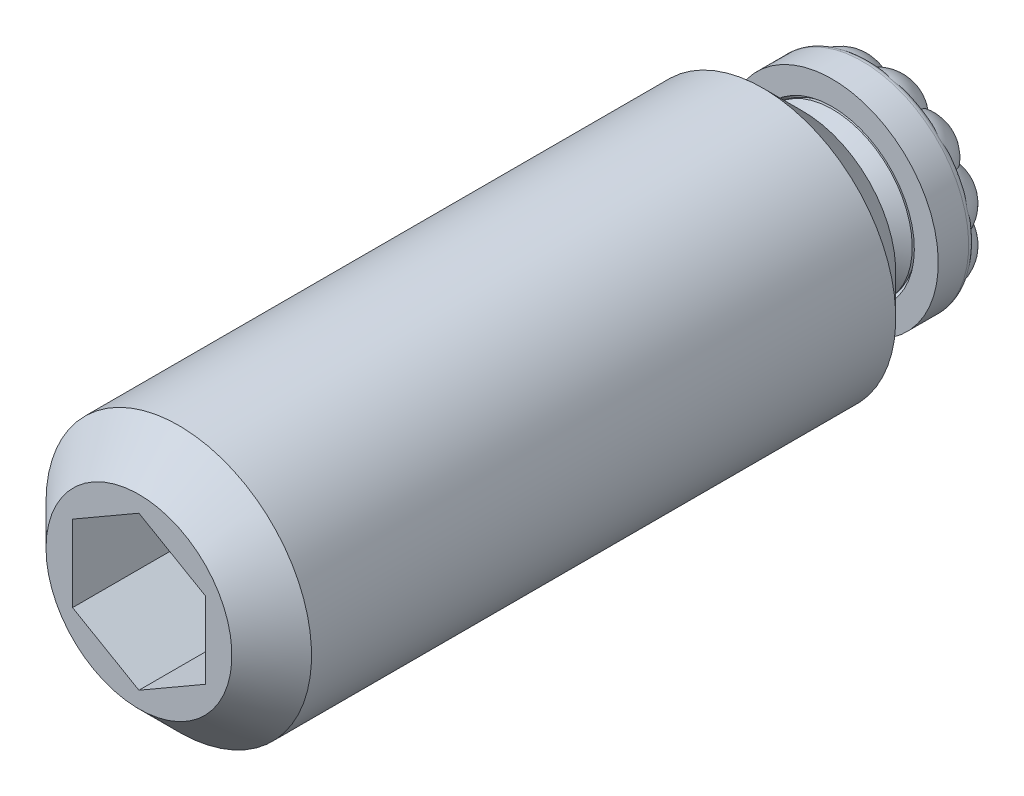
ISO-10303-21;
HEADER;
FILE_DESCRIPTION(('STEP AP214'),'2;1');
FILE_NAME('part.step','',(''),(''),'','','');
FILE_SCHEMA(('AUTOMOTIVE_DESIGN { 1 0 10303 214 1 1 1 1 }'));
ENDSEC;
DATA;
#1=APPLICATION_CONTEXT('core data for automotive mechanical design processes');
#2=APPLICATION_PROTOCOL_DEFINITION('international standard','automotive_design',2000,#1);
#3=PRODUCT_CONTEXT('',#1,'mechanical');
#4=PRODUCT('Part','Part','',(#3));
#5=PRODUCT_RELATED_PRODUCT_CATEGORY('part','',(#4));
#6=PRODUCT_DEFINITION_FORMATION('','',#4);
#7=PRODUCT_DEFINITION_CONTEXT('part definition',#1,'design');
#8=PRODUCT_DEFINITION('design','',#6,#7);
#9=PRODUCT_DEFINITION_SHAPE('','',#8);
#10=(LENGTH_UNIT() NAMED_UNIT(*) SI_UNIT(.MILLI.,.METRE.));
#11=(NAMED_UNIT(*) PLANE_ANGLE_UNIT() SI_UNIT($,.RADIAN.));
#12=(NAMED_UNIT(*) SI_UNIT($,.STERADIAN.) SOLID_ANGLE_UNIT());
#13=UNCERTAINTY_MEASURE_WITH_UNIT(LENGTH_MEASURE(1.E-05),#10,'distance_accuracy_value','');
#14=(GEOMETRIC_REPRESENTATION_CONTEXT(3) GLOBAL_UNCERTAINTY_ASSIGNED_CONTEXT((#13)) GLOBAL_UNIT_ASSIGNED_CONTEXT((#10,
#11,#12)) REPRESENTATION_CONTEXT('',''));
#15=CARTESIAN_POINT('',(0.,0.,0.));
#16=DIRECTION('',(0.,0.,1.));
#17=DIRECTION('',(1.,0.,0.));
#18=AXIS2_PLACEMENT_3D('',#15,#16,#17);
#19=CARTESIAN_POINT('',(0.,0.,1.999359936));
#20=DIRECTION('',(0.,0.,-1.));
#21=DIRECTION('',(-0.965048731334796,-0.262070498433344,0.));
#22=AXIS2_PLACEMENT_3D('',#19,#20,#21);
#23=CYLINDRICAL_SURFACE('',#22,2.);
#24=CARTESIAN_POINT('',(0.,0.,3.5));
#25=DIRECTION('',(0.,0.,-1.));
#26=DIRECTION('',(-1.,0.,0.));
#27=AXIS2_PLACEMENT_3D('',#24,#25,#26);
#28=CIRCLE('',#27,2.);
#29=CARTESIAN_POINT('',(-2.,0.,3.5));
#30=VERTEX_POINT('',#29);
#31=EDGE_CURVE('E266',#30,#30,#28,.F.);
#32=ORIENTED_EDGE('',*,*,#31,.F.);
#33=EDGE_LOOP('',(#32));
#34=FACE_BOUND('',#33,.T.);
#35=CARTESIAN_POINT('',(0.,0.,3.21279150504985));
#36=DIRECTION('',(0.,0.,-1.));
#37=DIRECTION('',(-0.965048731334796,-0.262070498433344,0.));
#38=AXIS2_PLACEMENT_3D('',#35,#36,#37);
#39=CIRCLE('',#38,2.);
#40=CARTESIAN_POINT('',(-1.93009746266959,-0.524140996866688,3.21279150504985));
#41=VERTEX_POINT('',#40);
#42=EDGE_CURVE('E282',#41,#41,#39,.F.);
#43=ORIENTED_EDGE('',*,*,#42,.T.);
#44=EDGE_LOOP('',(#43));
#45=FACE_BOUND('',#44,.T.);
#46=ADVANCED_FACE('F14',(#34,#45),#23,.T.);
#47=CARTESIAN_POINT('',(0.,0.,3.0805674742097));
#48=DIRECTION('',(0.,0.,-1.));
#49=DIRECTION('',(-0.965048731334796,-0.262070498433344,0.));
#50=AXIS2_PLACEMENT_3D('',#47,#48,#49);
#51=CONICAL_SURFACE('',#50,2.,0.959931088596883);
#52=CARTESIAN_POINT('',(0.,0.,3.00472688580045));
#53=DIRECTION('',(0.,0.,-1.));
#54=DIRECTION('',(-0.965048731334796,-0.262070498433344,0.));
#55=AXIS2_PLACEMENT_3D('',#52,#53,#54);
#56=CIRCLE('',#55,2.10831158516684);
#57=CARTESIAN_POINT('',(-2.03462342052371,-0.552526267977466,3.00472688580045));
#58=VERTEX_POINT('',#57);
#59=EDGE_CURVE('E255',#58,#58,#56,.T.);
#60=ORIENTED_EDGE('',*,*,#59,.T.);
#61=EDGE_LOOP('',(#60));
#62=FACE_BOUND('',#61,.T.);
#63=CARTESIAN_POINT('',(0.,0.,2.380359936));
#64=DIRECTION('',(0.,0.,-1.));
#65=DIRECTION('',(-0.965048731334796,-0.262070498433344,0.));
#66=AXIS2_PLACEMENT_3D('',#63,#64,#65);
#67=CIRCLE('',#66,3.);
#68=CARTESIAN_POINT('',(-2.89514619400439,-0.786211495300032,2.380359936));
#69=VERTEX_POINT('',#68);
#70=EDGE_CURVE('E275',#69,#69,#67,.T.);
#71=ORIENTED_EDGE('',*,*,#70,.F.);
#72=EDGE_LOOP('',(#71));
#73=FACE_BOUND('',#72,.T.);
#74=ADVANCED_FACE('F352',(#62,#73),#51,.T.);
#75=CARTESIAN_POINT('',(0.,0.,2.380359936));
#76=DIRECTION('',(0.,0.,1.));
#77=DIRECTION('',(0.965048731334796,0.262070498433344,0.));
#78=AXIS2_PLACEMENT_3D('',#75,#76,#77);
#79=TOROIDAL_SURFACE('',#78,2.619,0.381);
#80=ORIENTED_EDGE('',*,*,#70,.T.);
#81=EDGE_LOOP('',(#80));
#82=FACE_BOUND('',#81,.T.);
#83=CARTESIAN_POINT('',(0.,0.,1.999359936));
#84=DIRECTION('',(0.,0.,1.));
#85=DIRECTION('',(0.965048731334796,0.262070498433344,0.));
#86=AXIS2_PLACEMENT_3D('',#83,#84,#85);
#87=CIRCLE('',#86,2.619);
#88=CARTESIAN_POINT('',(2.52746262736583,0.686362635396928,1.999359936));
#89=VERTEX_POINT('',#88);
#90=EDGE_CURVE('E278',#89,#89,#87,.F.);
#91=ORIENTED_EDGE('',*,*,#90,.F.);
#92=EDGE_LOOP('',(#91));
#93=FACE_BOUND('',#92,.T.);
#94=ADVANCED_FACE('F348',(#82,#93),#79,.T.);
#95=CARTESIAN_POINT('',(0.,0.,3.21279150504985));
#96=DIRECTION('',(0.,0.,-1.));
#97=DIRECTION('',(-0.965048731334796,-0.262070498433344,0.));
#98=AXIS2_PLACEMENT_3D('',#95,#96,#97);
#99=TOROIDAL_SURFACE('',#98,2.254,0.254);
#100=ORIENTED_EDGE('',*,*,#42,.F.);
#101=EDGE_LOOP('',(#100));
#102=FACE_BOUND('',#101,.T.);
#103=ORIENTED_EDGE('',*,*,#59,.F.);
#104=EDGE_LOOP('',(#103));
#105=FACE_BOUND('',#104,.T.);
#106=ADVANCED_FACE('F344',(#102,#105),#99,.F.);
#107=CARTESIAN_POINT('',(0.,0.,2.380609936));
#108=DIRECTION('',(0.,0.,1.));
#109=DIRECTION('',(0.965048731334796,0.262070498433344,0.));
#110=AXIS2_PLACEMENT_3D('',#107,#108,#109);
#111=SPHERICAL_SURFACE('',#110,2.38125);
#112=CARTESIAN_POINT('',(1.86394615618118,0.50617682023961,1.6466347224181));
#113=DIRECTION('',(-0.902108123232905,-0.24497822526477,0.355227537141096));
#114=DIRECTION('',(0.342811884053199,0.0930946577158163,0.934779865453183));
#115=AXIS2_PLACEMENT_3D('',#112,#113,#114);
#116=CIRCLE('',#115,1.18368986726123);
#117=CARTESIAN_POINT('',(1.59147290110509,0.00535958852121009,0.609300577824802));
#118=VERTEX_POINT('',#117);
#119=CARTESIAN_POINT('',(1.37557616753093,0.800377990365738,0.609300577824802));
#120=VERTEX_POINT('',#119);
#121=EDGE_CURVE('E314',#118,#120,#116,.F.);
#122=ORIENTED_EDGE('',*,*,#121,.F.);
#123=CARTESIAN_POINT('',(1.86731313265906,-0.49361109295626,1.6466347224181));
#124=DIRECTION('',(-0.903737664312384,0.238896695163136,0.355227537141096));
#125=DIRECTION('',(-0.255564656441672,-0.966791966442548,0.));
#126=AXIS2_PLACEMENT_3D('',#123,#124,#125);
#127=CIRCLE('',#126,1.18368986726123);
#128=CARTESIAN_POINT('',(1.38093575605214,-0.791094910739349,0.609300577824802));
#129=VERTEX_POINT('',#128);
#130=EDGE_CURVE('E311',#129,#118,#127,.F.);
#131=ORIENTED_EDGE('',*,*,#130,.F.);
#132=CARTESIAN_POINT('',(1.37033506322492,-1.36113631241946,1.6466347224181));
#133=DIRECTION('',(-0.663211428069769,0.658759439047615,0.355227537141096));
#134=DIRECTION('',(-0.704721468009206,-0.709484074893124,0.));
#135=AXIS2_PLACEMENT_3D('',#132,#133,#134);
#136=CIRCLE('',#135,1.18368986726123);
#137=CARTESIAN_POINT('',(0.800377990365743,-1.37557616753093,0.609300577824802));
#138=VERTEX_POINT('',#137);
#139=EDGE_CURVE('E306',#138,#129,#136,.F.);
#140=ORIENTED_EDGE('',*,*,#139,.F.);
#141=CARTESIAN_POINT('',(0.506176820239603,-1.86394615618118,1.6466347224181));
#142=DIRECTION('',(-0.244978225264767,0.902108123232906,0.355227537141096));
#143=DIRECTION('',(0.0930946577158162,-0.342811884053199,0.934779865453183));
#144=AXIS2_PLACEMENT_3D('',#141,#142,#143);
#145=CIRCLE('',#144,1.18368986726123);
#146=CARTESIAN_POINT('',(0.00535958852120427,-1.59147290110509,0.609300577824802));
#147=VERTEX_POINT('',#146);
#148=EDGE_CURVE('E303',#147,#138,#145,.F.);
#149=ORIENTED_EDGE('',*,*,#148,.F.);
#150=CARTESIAN_POINT('',(-0.493611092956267,-1.86731313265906,1.6466347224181));
#151=DIRECTION('',(0.238896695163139,0.903737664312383,0.355227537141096));
#152=DIRECTION('',(-0.966791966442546,0.255564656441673,0.));
#153=AXIS2_PLACEMENT_3D('',#150,#151,#152);
#154=CIRCLE('',#153,1.18368986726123);
#155=CARTESIAN_POINT('',(-0.791094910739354,-1.38093575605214,0.609300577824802));
#156=VERTEX_POINT('',#155);
#157=EDGE_CURVE('E300',#156,#147,#154,.F.);
#158=ORIENTED_EDGE('',*,*,#157,.F.);
#159=CARTESIAN_POINT('',(-1.36113631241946,-1.37033506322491,1.6466347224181));
#160=DIRECTION('',(0.658759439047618,0.663211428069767,0.355227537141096));
#161=DIRECTION('',(-0.709484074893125,0.704721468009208,0.));
#162=AXIS2_PLACEMENT_3D('',#159,#160,#161);
#163=CIRCLE('',#162,1.18368986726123);
#164=CARTESIAN_POINT('',(-1.37557616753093,-0.800377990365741,0.609300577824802));
#165=VERTEX_POINT('',#164);
#166=EDGE_CURVE('E297',#165,#156,#163,.F.);
#167=ORIENTED_EDGE('',*,*,#166,.F.);
#168=CARTESIAN_POINT('',(-1.86394615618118,-0.506176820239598,1.6466347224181));
#169=DIRECTION('',(0.902108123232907,0.244978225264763,0.355227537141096));
#170=DIRECTION('',(0.342811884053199,0.0930946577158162,-0.934779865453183));
#171=AXIS2_PLACEMENT_3D('',#168,#169,#170);
#172=CIRCLE('',#171,1.18368986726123);
#173=CARTESIAN_POINT('',(-1.5914729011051,-0.00535958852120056,0.609300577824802));
#174=VERTEX_POINT('',#173);
#175=EDGE_CURVE('E294',#174,#165,#172,.F.);
#176=ORIENTED_EDGE('',*,*,#175,.F.);
#177=CARTESIAN_POINT('',(-1.86731313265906,0.493611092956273,1.6466347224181));
#178=DIRECTION('',(0.903737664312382,-0.238896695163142,0.355227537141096));
#179=DIRECTION('',(0.25556465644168,0.966791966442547,0.));
#180=AXIS2_PLACEMENT_3D('',#177,#178,#179);
#181=CIRCLE('',#180,1.18368986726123);
#182=CARTESIAN_POINT('',(-1.38093575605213,0.791094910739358,0.609300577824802));
#183=VERTEX_POINT('',#182);
#184=EDGE_CURVE('E291',#183,#174,#181,.F.);
#185=ORIENTED_EDGE('',*,*,#184,.F.);
#186=CARTESIAN_POINT('',(-1.37033506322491,1.36113631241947,1.6466347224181));
#187=DIRECTION('',(0.663211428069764,-0.658759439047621,0.355227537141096));
#188=DIRECTION('',(0.704721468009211,0.709484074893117,0.));
#189=AXIS2_PLACEMENT_3D('',#186,#187,#188);
#190=CIRCLE('',#189,1.18368986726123);
#191=CARTESIAN_POINT('',(-0.800377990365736,1.37557616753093,0.609300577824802));
#192=VERTEX_POINT('',#191);
#193=EDGE_CURVE('E288',#192,#183,#190,.F.);
#194=ORIENTED_EDGE('',*,*,#193,.F.);
#195=CARTESIAN_POINT('',(-0.506176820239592,1.86394615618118,1.6466347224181));
#196=DIRECTION('',(0.24497822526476,-0.902108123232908,0.355227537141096));
#197=DIRECTION('',(0.0930946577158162,-0.342811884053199,-0.934779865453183));
#198=AXIS2_PLACEMENT_3D('',#195,#196,#197);
#199=CIRCLE('',#198,1.18368986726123);
#200=CARTESIAN_POINT('',(-0.0053595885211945,1.59147290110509,0.609300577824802));
#201=VERTEX_POINT('',#200);
#202=EDGE_CURVE('E189',#201,#192,#199,.F.);
#203=ORIENTED_EDGE('',*,*,#202,.F.);
#204=CARTESIAN_POINT('',(0.493611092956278,1.86731313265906,1.6466347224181));
#205=DIRECTION('',(-0.238896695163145,-0.903737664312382,0.355227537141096));
#206=DIRECTION('',(0.966791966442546,-0.255564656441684,0.));
#207=AXIS2_PLACEMENT_3D('',#204,#205,#206);
#208=CIRCLE('',#207,1.18368986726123);
#209=CARTESIAN_POINT('',(0.791094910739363,1.38093575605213,0.609300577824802));
#210=VERTEX_POINT('',#209);
#211=EDGE_CURVE('E279',#210,#201,#208,.F.);
#212=ORIENTED_EDGE('',*,*,#211,.F.);
#213=CARTESIAN_POINT('',(1.36113631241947,1.3703350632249,1.6466347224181));
#214=DIRECTION('',(-0.658759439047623,-0.663211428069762,0.355227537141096));
#215=DIRECTION('',(0.709484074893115,-0.704721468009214,0.));
#216=AXIS2_PLACEMENT_3D('',#213,#214,#215);
#217=CIRCLE('',#216,1.18368986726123);
#218=EDGE_CURVE('E308',#120,#210,#217,.F.);
#219=ORIENTED_EDGE('',*,*,#218,.F.);
#220=EDGE_LOOP('',(#122,#131,#140,#149,#158,#167,#176,#185,#194,#203,#212,#219));
#221=FACE_BOUND('',#220,.T.);
#222=ADVANCED_FACE('F340',(#221),#111,.T.);
#223=CARTESIAN_POINT('',(0.,0.,0.999359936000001));
#224=DIRECTION('',(0.,0.,1.));
#225=DIRECTION('',(0.262070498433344,-0.965048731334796,0.));
#226=AXIS2_PLACEMENT_3D('',#223,#224,#225);
#227=PLANE('',#226);
#228=CARTESIAN_POINT('',(2.52423339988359,-0.667263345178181,0.999359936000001));
#229=DIRECTION('',(0.,0.,1.));
#230=DIRECTION('',(-0.255564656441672,-0.966791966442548,0.));
#231=AXIS2_PLACEMENT_3D('',#228,#229,#230);
#232=CIRCLE('',#231,1.33346353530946);
#233=CARTESIAN_POINT('',(3.31804421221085,-1.7387060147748,0.999359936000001));
#234=VERTEX_POINT('',#233);
#235=CARTESIAN_POINT('',(3.18579842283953,-1.82504429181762,0.999359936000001));
#236=VERTEX_POINT('',#235);
#237=EDGE_CURVE('E814',#234,#236,#232,.F.);
#238=ORIENTED_EDGE('',*,*,#237,.F.);
#239=CARTESIAN_POINT('',(0.,0.,0.999359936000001));
#240=DIRECTION('',(0.,0.,-1.));
#241=DIRECTION('',(-0.262070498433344,0.965048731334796,0.));
#242=AXIS2_PLACEMENT_3D('',#239,#240,#241);
#243=CIRCLE('',#242,3.746);
#244=CARTESIAN_POINT('',(3.17821251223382,-1.98279631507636,0.999359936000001));
#245=VERTEX_POINT('',#244);
#246=EDGE_CURVE('E844',#234,#245,#243,.T.);
#247=ORIENTED_EDGE('',*,*,#246,.T.);
#248=CARTESIAN_POINT('',(1.85241857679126,-1.83998370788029,0.999359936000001));
#249=DIRECTION('',(0.,0.,1.));
#250=DIRECTION('',(-0.704721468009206,-0.709484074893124,0.));
#251=AXIS2_PLACEMENT_3D('',#248,#249,#250);
#252=CIRCLE('',#251,1.33346353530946);
#253=EDGE_CURVE('E1024',#236,#245,#252,.F.);
#254=ORIENTED_EDGE('',*,*,#253,.F.);
#255=EDGE_LOOP('',(#238,#247,#254));
#256=FACE_BOUND('',#255,.T.);
#257=ADVANCED_FACE('F343',(#256),#227,.F.);
#258=CARTESIAN_POINT('',(1.85241857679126,-1.83998370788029,1.388422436));
#259=DIRECTION('',(0.,0.,-1.));
#260=DIRECTION('',(0.709484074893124,-0.704721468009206,0.));
#261=AXIS2_PLACEMENT_3D('',#258,#259,#260);
#262=SPHERICAL_SURFACE('',#261,1.3890625);
#263=CARTESIAN_POINT('',(1.26833413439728,-2.17983281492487,1.388422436));
#264=DIRECTION('',(-0.864336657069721,-0.502913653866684,0.));
#265=DIRECTION('',(0.502913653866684,-0.864336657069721,0.));
#266=AXIS2_PLACEMENT_3D('',#263,#264,#265);
#267=CIRCLE('',#266,1.21360725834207);
#268=CARTESIAN_POINT('',(1.84646021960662,-3.1734339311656,0.999359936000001));
#269=VERTEX_POINT('',#268);
#270=EDGE_CURVE('E812',#138,#269,#267,.T.);
#271=ORIENTED_EDGE('',*,*,#270,.F.);
#272=ORIENTED_EDGE('',*,*,#139,.T.);
#273=CARTESIAN_POINT('',(2.18832598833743,-1.25362352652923,1.388422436));
#274=DIRECTION('',(-0.497080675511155,-0.867704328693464,0.));
#275=DIRECTION('',(0.867704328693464,-0.497080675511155,0.));
#276=AXIS2_PLACEMENT_3D('',#273,#274,#275);
#277=CIRCLE('',#276,1.21360725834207);
#278=EDGE_CURVE('E183',#129,#236,#277,.T.);
#279=ORIENTED_EDGE('',*,*,#278,.T.);
#280=ORIENTED_EDGE('',*,*,#253,.T.);
#281=CARTESIAN_POINT('',(3.17796791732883,-1.44726793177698,1.253559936));
#282=CARTESIAN_POINT('',(3.1772679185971,-1.44875046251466,1.24235210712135));
#283=CARTESIAN_POINT('',(3.17682605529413,-1.45151663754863,1.23138401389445));
#284=CARTESIAN_POINT('',(3.17635990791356,-1.45909058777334,1.21033094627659));
#285=CARTESIAN_POINT('',(3.17632976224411,-1.46386870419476,1.20023561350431));
#286=CARTESIAN_POINT('',(3.1765732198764,-1.47496340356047,1.1810788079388));
#287=CARTESIAN_POINT('',(3.17684427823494,-1.48126674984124,1.1720093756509));
#288=CARTESIAN_POINT('',(3.17758359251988,-1.49506229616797,1.15479039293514));
#289=CARTESIAN_POINT('',(3.17805265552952,-1.50255928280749,1.14664478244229));
#290=CARTESIAN_POINT('',(3.17951004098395,-1.52461612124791,1.12526229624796));
#291=CARTESIAN_POINT('',(3.18061792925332,-1.54012212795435,1.11301283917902));
#292=CARTESIAN_POINT('',(3.18283958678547,-1.57277856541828,1.09098682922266));
#293=CARTESIAN_POINT('',(3.18395336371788,-1.589932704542,1.08121604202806));
#294=CARTESIAN_POINT('',(3.18670831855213,-1.63821318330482,1.05733295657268));
#295=CARTESIAN_POINT('',(3.18813801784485,-1.67036802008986,1.04528484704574));
#296=CARTESIAN_POINT('',(3.18974165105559,-1.73605908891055,1.02587031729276));
#297=CARTESIAN_POINT('',(3.18991261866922,-1.76959839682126,1.01851499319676));
#298=CARTESIAN_POINT('',(3.18826199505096,-1.85905082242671,1.00394827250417));
#299=CARTESIAN_POINT('',(3.18508561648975,-1.91545637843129,0.999883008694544));
#300=CARTESIAN_POINT('',(3.17368938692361,-2.02768935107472,0.998932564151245));
#301=CARTESIAN_POINT('',(3.16546784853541,-2.08351656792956,1.00204978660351));
#302=CARTESIAN_POINT('',(3.14013901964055,-2.21104431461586,1.01547854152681));
#303=CARTESIAN_POINT('',(3.12103954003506,-2.28215824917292,1.02775966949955));
#304=CARTESIAN_POINT('',(3.08498361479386,-2.38544391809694,1.05054161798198));
#305=CARTESIAN_POINT('',(3.07165726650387,-2.41944660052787,1.05890766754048));
#306=CARTESIAN_POINT('',(3.04246830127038,-2.48608148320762,1.07660351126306));
#307=CARTESIAN_POINT('',(3.02660701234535,-2.51871438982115,1.08593279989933));
#308=CARTESIAN_POINT('',(2.99753956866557,-2.57262646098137,1.10189599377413));
#309=CARTESIAN_POINT('',(2.98502584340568,-2.5943000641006,1.10847268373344));
#310=CARTESIAN_POINT('',(2.95864534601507,-2.63689680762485,1.12130011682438));
#311=CARTESIAN_POINT('',(2.94477937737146,-2.65782038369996,1.12755105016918));
#312=CARTESIAN_POINT('',(2.91580517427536,-2.69850891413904,1.13885994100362));
#313=CARTESIAN_POINT('',(2.9007260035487,-2.71828842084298,1.14393855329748));
#314=CARTESIAN_POINT('',(2.86892574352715,-2.75692518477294,1.15164718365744));
#315=CARTESIAN_POINT('',(2.85221215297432,-2.77578610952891,1.15428785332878));
#316=CARTESIAN_POINT('',(2.81982658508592,-2.80946940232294,1.15566534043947));
#317=CARTESIAN_POINT('',(2.80437037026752,-2.82447482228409,1.15492513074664));
#318=CARTESIAN_POINT('',(2.77263580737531,-2.85330131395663,1.15104610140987));
#319=CARTESIAN_POINT('',(2.75635521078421,-2.86711883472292,1.14790035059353));
#320=CARTESIAN_POINT('',(2.72293875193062,-2.89379899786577,1.14014287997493));
#321=CARTESIAN_POINT('',(2.70579318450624,-2.90664200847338,1.13550771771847));
#322=CARTESIAN_POINT('',(2.67096206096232,-2.93125010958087,1.12555678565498));
#323=CARTESIAN_POINT('',(2.65327680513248,-2.94301578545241,1.12024138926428));
#324=CARTESIAN_POINT('',(2.60343791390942,-2.97433286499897,1.10518120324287));
#325=CARTESIAN_POINT('',(2.57069899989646,-2.99284700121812,1.09519781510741));
#326=CARTESIAN_POINT('',(2.50363124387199,-3.02708681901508,1.0758216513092));
#327=CARTESIAN_POINT('',(2.46930160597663,-3.04281108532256,1.06642917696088));
#328=CARTESIAN_POINT('',(2.36459381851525,-3.08573909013,1.04026713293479));
#329=CARTESIAN_POINT('',(2.29202992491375,-3.10898504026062,1.02534906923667));
#330=CARTESIAN_POINT('',(2.1613353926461,-3.14078119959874,1.00707556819));
#331=CARTESIAN_POINT('',(2.10398964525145,-3.15153101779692,1.001789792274));
#332=CARTESIAN_POINT('',(1.98823509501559,-3.16746181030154,0.998231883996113));
#333=CARTESIAN_POINT('',(1.92982734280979,-3.17264801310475,0.999953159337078));
#334=CARTESIAN_POINT('',(1.83976930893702,-3.17689128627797,1.01018408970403));
#335=CARTESIAN_POINT('',(1.80780303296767,-3.17765030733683,1.01532386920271));
#336=CARTESIAN_POINT('',(1.74465594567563,-3.17787483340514,1.02929816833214));
#337=CARTESIAN_POINT('',(1.71347443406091,-3.17734153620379,1.03812926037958));
#338=CARTESIAN_POINT('',(1.66193474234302,-3.17563885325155,1.05713685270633));
#339=CARTESIAN_POINT('',(1.6411307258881,-3.17470766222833,1.06611929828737));
#340=CARTESIAN_POINT('',(1.60097114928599,-3.17259558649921,1.08688733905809));
#341=CARTESIAN_POINT('',(1.58161256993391,-3.17141524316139,1.09866686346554));
#342=CARTESIAN_POINT('',(1.55269441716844,-3.16961106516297,1.12021651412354));
#343=CARTESIAN_POINT('',(1.54232377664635,-3.16895424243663,1.12889117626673));
#344=CARTESIAN_POINT('',(1.52286734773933,-3.1677946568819,1.14761018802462));
#345=CARTESIAN_POINT('',(1.51378058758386,-3.16729177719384,1.1576534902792));
#346=CARTESIAN_POINT('',(1.49935636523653,-3.16667581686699,1.17667351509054));
#347=CARTESIAN_POINT('',(1.49363812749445,-3.16649937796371,1.1853572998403));
#348=CARTESIAN_POINT('',(1.48365055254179,-3.16641431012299,1.20350842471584));
#349=CARTESIAN_POINT('',(1.47937616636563,-3.16650473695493,1.21297288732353));
#350=CARTESIAN_POINT('',(1.47427828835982,-3.16690223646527,1.22773684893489));
#351=CARTESIAN_POINT('',(1.4727887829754,-3.16708200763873,1.23281421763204));
#352=CARTESIAN_POINT('',(1.47031921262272,-3.16753953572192,1.24310097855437));
#353=CARTESIAN_POINT('',(1.46934052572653,-3.16781755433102,1.24831068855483));
#354=CARTESIAN_POINT('',(1.46863968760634,-3.16814804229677,1.253559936));
#355=B_SPLINE_CURVE_WITH_KNOTS('',3,(#281,#282,#283,#284,#285,#286,#287,#288,#289,#290,#291,
#292,#293,#294,#295,#296,#297,#298,#299,#300,#301,#302,#303,#304,#305,#306,#307,#308,#309,#310,
#311,#312,#313,#314,#315,#316,#317,#318,#319,#320,#321,#322,#323,#324,#325,#326,#327,#328,#329,
#330,#331,#332,#333,#334,#335,#336,#337,#338,#339,#340,#341,#342,#343,#344,#345,#346,#347,#348,
#349,#350,#351,#352,#353,#354),.UNSPECIFIED.,.F.,.F.,(4,2,2,2,2,2,2,2,2,2,2,2,2,2,2,2,2,2,2,2,2,
2,2,2,2,2,2,2,2,2,2,2,2,2,2,2,4),(0.,0.0337831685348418,0.0670848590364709,0.100107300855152,
0.133265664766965,0.192299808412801,0.251470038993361,0.353992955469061,0.456757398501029,
0.625733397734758,0.794765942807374,1.01745457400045,1.12976568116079,1.24201814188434,
1.31960951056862,1.39715505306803,1.47320732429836,1.54892572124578,1.61336391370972,
1.67798847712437,1.7436845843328,1.809344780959,1.92591955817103,2.04255330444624,
2.27412506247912,2.44934331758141,2.62439676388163,2.7213791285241,2.81827163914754,
2.88616012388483,2.95390258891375,2.99441599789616,3.03489857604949,3.06599129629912,
3.09697413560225,3.11283290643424,3.12873424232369),.UNSPECIFIED.);
#356=CARTESIAN_POINT('',(2.0041575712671,-3.16478568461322,0.999359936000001));
#357=VERTEX_POINT('',#356);
#358=EDGE_CURVE('E1018',#245,#357,#355,.T.);
#359=ORIENTED_EDGE('',*,*,#358,.T.);
#360=EDGE_CURVE('E1026',#357,#269,#252,.F.);
#361=ORIENTED_EDGE('',*,*,#360,.T.);
#362=EDGE_LOOP('',(#271,#272,#279,#280,#359,#361));
#363=FACE_BOUND('',#362,.T.);
#364=ADVANCED_FACE('F338',(#363),#262,.T.);
#365=ORIENTED_EDGE('',*,*,#360,.F.);
#366=CARTESIAN_POINT('',(1.76101461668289,-3.30625823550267,0.999359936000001));
#367=VERTEX_POINT('',#366);
#368=EDGE_CURVE('E849',#357,#367,#243,.T.);
#369=ORIENTED_EDGE('',*,*,#368,.T.);
#370=CARTESIAN_POINT('',(0.684249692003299,-2.51968192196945,0.999359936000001));
#371=DIRECTION('',(0.,0.,1.));
#372=DIRECTION('',(-0.965048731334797,-0.26207049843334,0.));
#373=AXIS2_PLACEMENT_3D('',#370,#371,#372);
#374=CIRCLE('',#373,1.33346353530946);
#375=EDGE_CURVE('E1010',#269,#367,#374,.F.);
#376=ORIENTED_EDGE('',*,*,#375,.F.);
#377=EDGE_LOOP('',(#365,#369,#376));
#378=FACE_BOUND('',#377,.T.);
#379=ADVANCED_FACE('F564',(#378),#227,.F.);
#380=CARTESIAN_POINT('',(0.684249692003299,-2.51968192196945,1.388422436));
#381=DIRECTION('',(0.,0.,-1.));
#382=DIRECTION('',(0.26207049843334,-0.965048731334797,0.));
#383=AXIS2_PLACEMENT_3D('',#380,#381,#382);
#384=SPHERICAL_SURFACE('',#383,1.3890625);
#385=CARTESIAN_POINT('',(0.00849317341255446,-2.52195766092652,1.388422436));
#386=DIRECTION('',(-0.999994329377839,-0.00336767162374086,0.));
#387=DIRECTION('',(0.00336767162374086,-0.999994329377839,0.));
#388=AXIS2_PLACEMENT_3D('',#385,#386,#387);
#389=CIRCLE('',#388,1.21360725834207);
#390=CARTESIAN_POINT('',(0.0123644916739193,-3.67150451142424,0.999359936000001));
#391=VERTEX_POINT('',#390);
#392=EDGE_CURVE('E1025',#147,#391,#389,.T.);
#393=ORIENTED_EDGE('',*,*,#392,.F.);
#394=ORIENTED_EDGE('',*,*,#148,.T.);
#395=ORIENTED_EDGE('',*,*,#270,.T.);
#396=ORIENTED_EDGE('',*,*,#375,.T.);
#397=CARTESIAN_POINT('',(2.0285669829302,-2.84235475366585,1.253559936));
#398=CARTESIAN_POINT('',(2.02721950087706,-2.84328866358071,1.24235210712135));
#399=CARTESIAN_POINT('',(2.0254537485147,-2.84546330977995,1.23138401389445));
#400=CARTESIAN_POINT('',(2.02126307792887,-2.85178946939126,1.21033094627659));
#401=CARTESIAN_POINT('',(2.01884791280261,-2.85591236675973,1.20023561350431));
#402=CARTESIAN_POINT('',(2.01351140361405,-2.86564238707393,1.1810788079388));
#403=CARTESIAN_POINT('',(2.01059447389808,-2.8712367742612,1.1720093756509));
#404=CARTESIAN_POINT('',(2.00433696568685,-2.8835537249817,1.15479039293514));
#405=CARTESIAN_POINT('',(2.00099469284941,-2.89028083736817,1.14664478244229));
#406=CARTESIAN_POINT('',(1.99122840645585,-2.91011131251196,1.12526229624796));
#407=CARTESIAN_POINT('',(1.98443486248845,-2.92409385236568,1.11301283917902));
#408=CARTESIAN_POINT('',(1.97003065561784,-2.95348598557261,1.09098682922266));
#409=CARTESIAN_POINT('',(1.9624181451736,-2.96889879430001,1.08121604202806));
#410=CARTESIAN_POINT('',(1.94066376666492,-3.01208839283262,1.05733295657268));
#411=CARTESIAN_POINT('',(1.92582450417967,-3.04065014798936,1.04528484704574));
#412=CARTESIAN_POINT('',(1.89436775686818,-3.09834209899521,1.02587031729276));
#413=CARTESIAN_POINT('',(1.87774616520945,-3.12747347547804,1.01851499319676));
#414=CARTESIAN_POINT('',(1.83159047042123,-3.20411623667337,1.00394827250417));
#415=CARTESIAN_POINT('',(1.80063686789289,-3.25137669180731,0.999883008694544));
#416=CARTESIAN_POINT('',(1.73465095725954,-3.3428751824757,0.998932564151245));
#417=CARTESIAN_POINT('',(1.69961728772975,-3.38711220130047,1.00204978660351));
#418=CARTESIAN_POINT('',(1.61391800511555,-3.48489005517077,1.01547854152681));
#419=CARTESIAN_POINT('',(1.56182040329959,-3.5369267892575,1.02775966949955));
#420=CARTESIAN_POINT('',(1.47895222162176,-3.60834683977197,1.05054161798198));
#421=CARTESIAN_POINT('',(1.45040992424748,-3.63113085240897,1.05890766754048));
#422=CARTESIAN_POINT('',(1.39181409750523,-3.67424387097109,1.07660351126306));
#423=CARTESIAN_POINT('',(1.36176136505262,-3.69457415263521,1.08593279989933));
#424=CARTESIAN_POINT('',(1.30963218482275,-3.72672965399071,1.10189599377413));
#425=CARTESIAN_POINT('',(1.28795817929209,-3.73924268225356,1.10847268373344));
#426=CARTESIAN_POINT('',(1.24381362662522,-3.76294229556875,1.12130011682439));
#427=CARTESIAN_POINT('',(1.22134355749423,-3.774129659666,1.12755105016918));
#428=CARTESIAN_POINT('',(1.17590689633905,-3.79487985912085,1.13885994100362));
#429=CARTESIAN_POINT('',(1.15295819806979,-3.80446982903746,1.14393855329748));
#430=CARTESIAN_POINT('',(1.10609998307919,-3.82203011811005,1.15164718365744));
#431=CARTESIAN_POINT('',(1.082195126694,-3.83000736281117,1.15428785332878));
#432=CARTESIAN_POINT('',(1.03730675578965,-3.84298516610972,1.15566534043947));
#433=CARTESIAN_POINT('',(1.01641857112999,-3.84825213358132,1.15492513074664));
#434=CARTESIAN_POINT('',(0.974522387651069,-3.85734932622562,1.15104610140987));
#435=CARTESIAN_POINT('',(0.953514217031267,-3.86117535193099,1.14790035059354));
#436=CARTESIAN_POINT('',(0.911234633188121,-3.86757282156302,1.14014287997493));
#437=CARTESIAN_POINT('',(0.889964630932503,-3.87012241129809,1.13550771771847));
#438=CARTESIAN_POINT('',(0.847495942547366,-3.87401809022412,1.12555678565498));
#439=CARTESIAN_POINT('',(0.826297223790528,-3.87536483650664,1.12024138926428));
#440=CARTESIAN_POINT('',(0.76747693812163,-3.87756677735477,1.10518120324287));
#441=CARTESIAN_POINT('',(0.729867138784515,-3.8772310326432,1.09519781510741));
#442=CARTESIAN_POINT('',(0.654664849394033,-3.87334970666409,1.0758216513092));
#443=CARTESIAN_POINT('',(0.617072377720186,-3.86980250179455,1.06642917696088));
#444=CARTESIAN_POINT('',(0.504928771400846,-3.85462535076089,1.04026713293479));
#445=CARTESIAN_POINT('',(0.430463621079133,-3.83847498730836,1.02534906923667));
#446=CARTESIAN_POINT('',(0.301380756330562,-3.80066400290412,1.00707556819));
#447=CARTESIAN_POINT('',(0.246342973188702,-3.78130074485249,1.001789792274));
#448=CARTESIAN_POINT('',(0.138131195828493,-3.73721994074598,0.998231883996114));
#449=CARTESIAN_POINT('',(0.0849554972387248,-3.71250744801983,0.999953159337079));
#450=CARTESIAN_POINT('',(0.00484131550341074,-3.67115321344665,1.01018408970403));
#451=CARTESIAN_POINT('',(-0.0232218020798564,-3.65582740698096,1.01532386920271));
#452=CARTESIAN_POINT('',(-0.0780210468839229,-3.62444830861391,1.02929816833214));
#453=CARTESIAN_POINT('',(-0.104758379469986,-3.60839570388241,1.03812926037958));
#454=CARTESIAN_POINT('',(-0.148541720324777,-3.58115129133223,1.05713685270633));
#455=CARTESIAN_POINT('',(-0.166092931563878,-3.56994284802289,1.06611929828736));
#456=CARTESIAN_POINT('',(-0.199816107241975,-3.54803394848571,1.08688733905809));
#457=CARTESIAN_POINT('',(-0.215990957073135,-3.53733245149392,1.09866686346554));
#458=CARTESIAN_POINT('',(-0.240132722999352,-3.52131091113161,1.12021651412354));
#459=CARTESIAN_POINT('',(-0.248785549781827,-3.51555676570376,1.12889117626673));
#460=CARTESIAN_POINT('',(-0.265055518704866,-3.504824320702,1.14761018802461));
#461=CARTESIAN_POINT('',(-0.272673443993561,-3.49984543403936,1.1576534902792));
#462=CARTESIAN_POINT('',(-0.284857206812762,-3.49209988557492,1.17667351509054));
#463=CARTESIAN_POINT('',(-0.289721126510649,-3.48908796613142,1.1853572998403));
#464=CARTESIAN_POINT('',(-0.29832808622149,-3.48402050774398,1.20350842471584));
#465=CARTESIAN_POINT('',(-0.302075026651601,-3.48196162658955,1.21297288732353));
#466=CARTESIAN_POINT('',(-0.306688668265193,-3.47975693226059,1.22773684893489));
#467=CARTESIAN_POINT('',(-0.308068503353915,-3.47916786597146,1.23281421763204));
#468=CARTESIAN_POINT('',(-0.310435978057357,-3.47832931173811,1.24310097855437));
#469=CARTESIAN_POINT('',(-0.311422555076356,-3.47808073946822,1.24831068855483));
#470=CARTESIAN_POINT('',(-0.312194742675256,-3.47801653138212,1.253559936));
#471=B_SPLINE_CURVE_WITH_KNOTS('',3,(#397,#398,#399,#400,#401,#402,#403,#404,#405,#406,#407,
#408,#409,#410,#411,#412,#413,#414,#415,#416,#417,#418,#419,#420,#421,#422,#423,#424,#425,#426,
#427,#428,#429,#430,#431,#432,#433,#434,#435,#436,#437,#438,#439,#440,#441,#442,#443,#444,#445,
#446,#447,#448,#449,#450,#451,#452,#453,#454,#455,#456,#457,#458,#459,#460,#461,#462,#463,#464,
#465,#466,#467,#468,#469,#470),.UNSPECIFIED.,.F.,.F.,(4,2,2,2,2,2,2,2,2,2,2,2,2,2,2,2,2,2,2,2,2,
2,2,2,2,2,2,2,2,2,2,2,2,2,2,2,4),(0.,0.0337831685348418,0.0670848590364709,0.100107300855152,
0.133265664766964,0.192299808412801,0.251470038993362,0.353992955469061,0.456757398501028,
0.625733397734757,0.794765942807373,1.01745457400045,1.12976568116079,1.24201814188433,
1.31960951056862,1.39715505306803,1.47320732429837,1.54892572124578,1.61336391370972,
1.67798847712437,1.7436845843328,1.809344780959,1.92591955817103,2.04255330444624,
2.27412506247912,2.44934331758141,2.62439676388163,2.7213791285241,2.81827163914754,
2.88616012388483,2.95390258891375,2.99441599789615,3.03489857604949,3.06599129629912,
3.09697413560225,3.11283290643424,3.12873424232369),.UNSPECIFIED.);
#472=CARTESIAN_POINT('',(0.153258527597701,-3.74286358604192,0.999359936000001));
#473=VERTEX_POINT('',#472);
#474=EDGE_CURVE('E1002',#367,#473,#471,.T.);
#475=ORIENTED_EDGE('',*,*,#474,.T.);
#476=EDGE_CURVE('E1011',#473,#391,#374,.F.);
#477=ORIENTED_EDGE('',*,*,#476,.T.);
#478=EDGE_LOOP('',(#393,#394,#395,#396,#475,#477));
#479=FACE_BOUND('',#478,.T.);
#480=ADVANCED_FACE('F686',(#479),#384,.T.);
#481=ORIENTED_EDGE('',*,*,#476,.F.);
#482=CARTESIAN_POINT('',(-0.128045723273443,-3.74381093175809,0.999359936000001));
#483=VERTEX_POINT('',#482);
#484=EDGE_CURVE('E852',#473,#483,#243,.T.);
#485=ORIENTED_EDGE('',*,*,#484,.T.);
#486=CARTESIAN_POINT('',(-0.667263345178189,-2.52423339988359,0.999359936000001));
#487=DIRECTION('',(0.,0.,1.));
#488=DIRECTION('',(-0.966791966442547,0.255564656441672,0.));
#489=AXIS2_PLACEMENT_3D('',#486,#487,#488);
#490=CIRCLE('',#489,1.33346353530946);
#491=EDGE_CURVE('E995',#391,#483,#490,.F.);
#492=ORIENTED_EDGE('',*,*,#491,.F.);
#493=EDGE_LOOP('',(#481,#485,#492));
#494=FACE_BOUND('',#493,.T.);
#495=ADVANCED_FACE('F677',(#494),#227,.F.);
#496=CARTESIAN_POINT('',(-0.667263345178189,-2.52423339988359,1.388422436));
#497=DIRECTION('',(0.,0.,-1.));
#498=DIRECTION('',(-0.255564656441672,-0.966791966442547,0.));
#499=AXIS2_PLACEMENT_3D('',#496,#497,#498);
#500=SPHERICAL_SURFACE('',#499,1.3890625);
#501=CARTESIAN_POINT('',(-1.25362352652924,-2.18832598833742,1.388422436));
#502=DIRECTION('',(-0.867704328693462,0.497080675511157,0.));
#503=DIRECTION('',(-0.497080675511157,-0.867704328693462,0.));
#504=AXIS2_PLACEMENT_3D('',#501,#502,#503);
#505=CIRCLE('',#504,1.21360725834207);
#506=CARTESIAN_POINT('',(-1.82504429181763,-3.18579842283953,0.999359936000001));
#507=VERTEX_POINT('',#506);
#508=EDGE_CURVE('E1000',#156,#507,#505,.T.);
#509=ORIENTED_EDGE('',*,*,#508,.F.);
#510=ORIENTED_EDGE('',*,*,#157,.T.);
#511=ORIENTED_EDGE('',*,*,#392,.T.);
#512=ORIENTED_EDGE('',*,*,#491,.T.);
#513=CARTESIAN_POINT('',(0.335613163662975,-3.47583491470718,1.253559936));
#514=CARTESIAN_POINT('',(0.333979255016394,-3.47596996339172,1.24235210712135));
#515=CARTESIAN_POINT('',(0.331362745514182,-3.47697038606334,1.23138401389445));
#516=CARTESIAN_POINT('',(0.324570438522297,-3.48035366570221,1.21033094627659));
#517=CARTESIAN_POINT('',(0.32041739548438,-3.48271661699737,1.20023561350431));
#518=CARTESIAN_POINT('',(0.310930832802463,-3.48847480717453,1.1810788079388));
#519=CARTESIAN_POINT('',(0.305607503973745,-3.49186122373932,1.1720093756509));
#520=CARTESIAN_POINT('',(0.294029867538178,-3.49939926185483,1.15479039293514));
#521=CARTESIAN_POINT('',(0.287771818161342,-3.5035539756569,1.14664478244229));
#522=CARTESIAN_POINT('',(0.269398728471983,-3.51584452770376,1.12526229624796));
#523=CARTESIAN_POINT('',(0.256524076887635,-3.52455699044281,1.11301283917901));
#524=CARTESIAN_POINT('',(0.229353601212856,-3.54280922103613,1.09098682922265));
#525=CARTESIAN_POINT('',(0.215054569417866,-3.5523508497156,1.08121604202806));
#526=CARTESIAN_POINT('',(0.174619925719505,-3.57887694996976,1.05733295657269));
#527=CARTESIAN_POINT('',(0.147487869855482,-3.59619252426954,1.04528484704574));
#528=CARTESIAN_POINT('',(0.0913995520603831,-3.63042684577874,1.02587031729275));
#529=CARTESIAN_POINT('',(0.0624391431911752,-3.64734456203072,1.01851499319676));
#530=CARTESIAN_POINT('',(-0.0158542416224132,-3.69064129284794,1.00394827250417));
#531=CARTESIAN_POINT('',(-0.0662910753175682,-3.71609324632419,0.999883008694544));
#532=CARTESIAN_POINT('',(-0.169185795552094,-3.76234030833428,0.998932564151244));
#533=CARTESIAN_POINT('',(-0.221644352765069,-3.78313385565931,1.00204978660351));
#534=CARTESIAN_POINT('',(-0.34475103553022,-3.8249623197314,1.01547854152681));
#535=CARTESIAN_POINT('',(-0.41588724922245,-3.84397865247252,1.02775966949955));
#536=CARTESIAN_POINT('',(-0.523363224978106,-3.86439613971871,1.05054161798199));
#537=CARTESIAN_POINT('',(-0.559473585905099,-3.86985652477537,1.05890766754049));
#538=CARTESIAN_POINT('',(-0.631775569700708,-3.87789558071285,1.07660351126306));
#539=CARTESIAN_POINT('',(-0.667967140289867,-3.88047575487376,1.08593279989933));
#540=CARTESIAN_POINT('',(-0.729190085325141,-3.88225864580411,1.10189599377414));
#541=CARTESIAN_POINT('',(-0.754216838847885,-3.8822582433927,1.10847268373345));
#542=CARTESIAN_POINT('',(-0.804296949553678,-3.88071043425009,1.1213001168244));
#543=CARTESIAN_POINT('',(-0.829350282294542,-3.8791639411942,1.12755105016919));
#544=CARTESIAN_POINT('',(-0.879074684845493,-3.87441581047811,1.13885994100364));
#545=CARTESIAN_POINT('',(-0.903743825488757,-3.87124661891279,1.14393855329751));
#546=CARTESIAN_POINT('',(-0.953104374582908,-3.86302516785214,1.15164718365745));
#547=CARTESIAN_POINT('',(-0.977795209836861,-3.85798123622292,1.15428785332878));
#548=CARTESIAN_POINT('',(-1.02315858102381,-3.8467761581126,1.15566534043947));
#549=CARTESIAN_POINT('',(-1.04388176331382,-3.84089339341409,1.15492513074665));
#550=CARTESIAN_POINT('',(-1.08471351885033,-3.82782370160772,1.1510461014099));
#551=CARTESIAN_POINT('',(-1.1048201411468,-3.8206330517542,1.14790035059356));
#552=CARTESIAN_POINT('',(-1.14463406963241,-3.8050336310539,1.14014287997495));
#553=CARTESIAN_POINT('',(-1.16432922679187,-3.7966066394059,1.13550771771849));
#554=CARTESIAN_POINT('',(-1.20305602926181,-3.77874605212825,1.125556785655));
#555=CARTESIAN_POINT('',(-1.22208803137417,-3.76931300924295,1.12024138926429));
#556=CARTESIAN_POINT('',(-1.27412886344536,-3.7418098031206,1.10518120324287));
#557=CARTESIAN_POINT('',(-1.30653203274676,-3.72271414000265,1.09519781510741));
#558=CARTESIAN_POINT('',(-1.36971846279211,-3.68175166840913,1.07582165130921));
#559=CARTESIAN_POINT('',(-1.40050089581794,-3.65988346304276,1.06642917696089));
#560=CARTESIAN_POINT('',(-1.49003153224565,-3.59066786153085,1.04026713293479));
#561=CARTESIAN_POINT('',(-1.54644506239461,-3.53944866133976,1.02534906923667));
#562=CARTESIAN_POINT('',(-1.63932861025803,-3.44216195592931,1.00707556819));
#563=CARTESIAN_POINT('',(-1.67731109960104,-3.39787399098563,1.001789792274));
#564=CARTESIAN_POINT('',(-1.74898484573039,-3.30559300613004,0.998231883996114));
#565=CARTESIAN_POINT('',(-1.78268010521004,-3.25760351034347,0.999953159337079));
#566=CARTESIAN_POINT('',(-1.83138390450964,-3.18173260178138,1.01018408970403));
#567=CARTESIAN_POINT('',(-1.84802437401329,-3.15442850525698,1.01532386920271));
#568=CARTESIAN_POINT('',(-1.87979236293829,-3.09985378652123,1.02929816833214));
#569=CARTESIAN_POINT('',(-1.89492126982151,-3.07258315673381,1.03812926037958));
#570=CARTESIAN_POINT('',(-1.91921654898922,-3.02709713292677,1.05713685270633));
#571=CARTESIAN_POINT('',(-1.9288121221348,-3.00861473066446,1.06611929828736));
#572=CARTESIAN_POINT('',(-1.94706279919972,-2.97277947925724,1.08688733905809));
#573=CARTESIAN_POINT('',(-1.95571988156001,-2.95542428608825,1.09866686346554));
#574=CARTESIAN_POINT('',(-1.96861649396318,-2.92947834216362,1.12021651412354));
#575=CARTESIAN_POINT('',(-1.97323298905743,-2.9201686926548,1.12889117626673));
#576=CARTESIAN_POINT('',(-1.98195697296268,-2.90273913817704,1.14761018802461));
#577=CARTESIAN_POINT('',(-1.9860648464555,-2.89461833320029,1.1576534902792));
#578=CARTESIAN_POINT('',(-1.99274352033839,-2.88181861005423,1.17667351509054));
#579=CARTESIAN_POINT('',(-1.99544983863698,-2.87677825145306,1.1853572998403));
#580=CARTESIAN_POINT('',(-2.0003699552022,-2.8680862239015,1.20350842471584));
#581=CARTESIAN_POINT('',(-2.00258546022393,-2.86442971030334,1.21297288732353));
#582=CARTESIAN_POINT('',(-2.00547864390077,-2.86021356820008,1.22773684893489));
#583=CARTESIAN_POINT('',(-2.00637908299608,-2.85901350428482,1.23281421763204));
#584=CARTESIAN_POINT('',(-2.0080100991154,-2.85710355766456,1.24310097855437));
#585=CARTESIAN_POINT('',(-2.0087402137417,-2.85639499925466,1.24831068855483));
#586=CARTESIAN_POINT('',(-2.00937684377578,-2.85595329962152,1.253559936));
#587=B_SPLINE_CURVE_WITH_KNOTS('',3,(#513,#514,#515,#516,#517,#518,#519,#520,#521,#522,#523,
#524,#525,#526,#527,#528,#529,#530,#531,#532,#533,#534,#535,#536,#537,#538,#539,#540,#541,#542,
#543,#544,#545,#546,#547,#548,#549,#550,#551,#552,#553,#554,#555,#556,#557,#558,#559,#560,#561,
#562,#563,#564,#565,#566,#567,#568,#569,#570,#571,#572,#573,#574,#575,#576,#577,#578,#579,#580,
#581,#582,#583,#584,#585,#586),.UNSPECIFIED.,.F.,.F.,(4,2,2,2,2,2,2,2,2,2,2,2,2,2,2,2,2,2,2,2,2,
2,2,2,2,2,2,2,2,2,2,2,2,2,2,2,4),(0.,0.0337831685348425,0.067084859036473,0.100107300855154,
0.133265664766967,0.192299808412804,0.251470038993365,0.353992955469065,0.456757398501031,
0.625733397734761,0.794765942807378,1.01745457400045,1.12976568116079,1.24201814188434,
1.31960951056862,1.39715505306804,1.47320732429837,1.54892572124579,1.61336391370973,
1.67798847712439,1.74368458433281,1.80934478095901,1.92591955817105,2.04255330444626,
2.27412506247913,2.44934331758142,2.62439676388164,2.72137912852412,2.81827163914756,
2.88616012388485,2.95390258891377,2.99441599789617,3.0348985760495,3.06599129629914,
3.09697413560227,3.11283290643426,3.12873424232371),.UNSPECIFIED.);
#588=CARTESIAN_POINT('',(-1.73870601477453,-3.318044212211,0.999359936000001));
#589=VERTEX_POINT('',#588);
#590=EDGE_CURVE('E988',#483,#589,#587,.T.);
#591=ORIENTED_EDGE('',*,*,#590,.T.);
#592=EDGE_CURVE('E997',#589,#507,#490,.F.);
#593=ORIENTED_EDGE('',*,*,#592,.T.);
#594=EDGE_LOOP('',(#509,#510,#511,#512,#591,#593));
#595=FACE_BOUND('',#594,.T.);
#596=ADVANCED_FACE('F669',(#595),#500,.T.);
#597=ORIENTED_EDGE('',*,*,#592,.F.);
#598=CARTESIAN_POINT('',(-1.98279631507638,-3.17821251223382,0.999359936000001));
#599=VERTEX_POINT('',#598);
#600=EDGE_CURVE('E857',#589,#599,#243,.T.);
#601=ORIENTED_EDGE('',*,*,#600,.T.);
#602=CARTESIAN_POINT('',(-1.83998370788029,-1.85241857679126,0.999359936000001));
#603=DIRECTION('',(0.,0.,1.));
#604=DIRECTION('',(-0.709484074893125,0.704721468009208,0.));
#605=AXIS2_PLACEMENT_3D('',#602,#603,#604);
#606=CIRCLE('',#605,1.33346353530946);
#607=EDGE_CURVE('E979',#507,#599,#606,.F.);
#608=ORIENTED_EDGE('',*,*,#607,.F.);
#609=EDGE_LOOP('',(#597,#601,#608));
#610=FACE_BOUND('',#609,.T.);
#611=ADVANCED_FACE('F660',(#610),#227,.F.);
#612=CARTESIAN_POINT('',(-1.83998370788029,-1.85241857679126,1.388422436));
#613=DIRECTION('',(0.,0.,-1.));
#614=DIRECTION('',(-0.704721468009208,-0.709484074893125,0.));
#615=AXIS2_PLACEMENT_3D('',#612,#613,#614);
#616=SPHERICAL_SURFACE('',#615,1.3890625);
#617=CARTESIAN_POINT('',(-2.17983281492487,-1.26833413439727,1.388422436));
#618=DIRECTION('',(-0.502913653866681,0.864336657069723,0.));
#619=DIRECTION('',(-0.864336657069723,-0.502913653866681,0.));
#620=AXIS2_PLACEMENT_3D('',#617,#618,#619);
#621=CIRCLE('',#620,1.21360725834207);
#622=CARTESIAN_POINT('',(-3.17343393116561,-1.84646021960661,0.999359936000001));
#623=VERTEX_POINT('',#622);
#624=EDGE_CURVE('E996',#165,#623,#621,.T.);
#625=ORIENTED_EDGE('',*,*,#624,.F.);
#626=ORIENTED_EDGE('',*,*,#166,.T.);
#627=ORIENTED_EDGE('',*,*,#508,.T.);
#628=ORIENTED_EDGE('',*,*,#607,.T.);
#629=CARTESIAN_POINT('',(-1.44726793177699,-3.17796791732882,1.253559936));
#630=CARTESIAN_POINT('',(-1.44875046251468,-3.17726791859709,1.24235210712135));
#631=CARTESIAN_POINT('',(-1.45151663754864,-3.17682605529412,1.23138401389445));
#632=CARTESIAN_POINT('',(-1.45909058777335,-3.17635990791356,1.21033094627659));
#633=CARTESIAN_POINT('',(-1.46386870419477,-3.17632976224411,1.20023561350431));
#634=CARTESIAN_POINT('',(-1.47496340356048,-3.1765732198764,1.1810788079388));
#635=CARTESIAN_POINT('',(-1.48126674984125,-3.17684427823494,1.1720093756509));
#636=CARTESIAN_POINT('',(-1.49506229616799,-3.17758359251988,1.15479039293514));
#637=CARTESIAN_POINT('',(-1.5025592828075,-3.17805265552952,1.14664478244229));
#638=CARTESIAN_POINT('',(-1.52461612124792,-3.17951004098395,1.12526229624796));
#639=CARTESIAN_POINT('',(-1.54012212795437,-3.18061792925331,1.11301283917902));
#640=CARTESIAN_POINT('',(-1.57277856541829,-3.18283958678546,1.09098682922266));
#641=CARTESIAN_POINT('',(-1.58993270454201,-3.18395336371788,1.08121604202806));
#642=CARTESIAN_POINT('',(-1.63821318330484,-3.18670831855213,1.05733295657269));
#643=CARTESIAN_POINT('',(-1.67036802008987,-3.18813801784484,1.04528484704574));
#644=CARTESIAN_POINT('',(-1.73605908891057,-3.18974165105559,1.02587031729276));
#645=CARTESIAN_POINT('',(-1.76959839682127,-3.18991261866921,1.01851499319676));
#646=CARTESIAN_POINT('',(-1.85905082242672,-3.18826199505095,1.00394827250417));
#647=CARTESIAN_POINT('',(-1.9154563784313,-3.18508561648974,0.999883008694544));
#648=CARTESIAN_POINT('',(-2.02768935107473,-3.17368938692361,0.998932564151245));
#649=CARTESIAN_POINT('',(-2.08351656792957,-3.1654678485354,1.00204978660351));
#650=CARTESIAN_POINT('',(-2.21104431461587,-3.14013901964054,1.01547854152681));
#651=CARTESIAN_POINT('',(-2.28215824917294,-3.12103954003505,1.02775966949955));
#652=CARTESIAN_POINT('',(-2.38544391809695,-3.08498361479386,1.05054161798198));
#653=CARTESIAN_POINT('',(-2.41944660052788,-3.07165726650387,1.05890766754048));
#654=CARTESIAN_POINT('',(-2.48608148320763,-3.04246830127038,1.07660351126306));
#655=CARTESIAN_POINT('',(-2.51871438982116,-3.02660701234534,1.08593279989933));
#656=CARTESIAN_POINT('',(-2.57262646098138,-2.99753956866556,1.10189599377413));
#657=CARTESIAN_POINT('',(-2.59430006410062,-2.98502584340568,1.10847268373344));
#658=CARTESIAN_POINT('',(-2.63689680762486,-2.95864534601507,1.12130011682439));
#659=CARTESIAN_POINT('',(-2.65782038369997,-2.94477937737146,1.12755105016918));
#660=CARTESIAN_POINT('',(-2.69850891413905,-2.91580517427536,1.13885994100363));
#661=CARTESIAN_POINT('',(-2.71828842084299,-2.9007260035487,1.14393855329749));
#662=CARTESIAN_POINT('',(-2.75692518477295,-2.86892574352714,1.15164718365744));
#663=CARTESIAN_POINT('',(-2.77578610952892,-2.85221215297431,1.15428785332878));
#664=CARTESIAN_POINT('',(-2.80946940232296,-2.81982658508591,1.15566534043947));
#665=CARTESIAN_POINT('',(-2.82447482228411,-2.80437037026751,1.15492513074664));
#666=CARTESIAN_POINT('',(-2.85330131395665,-2.7726358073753,1.15104610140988));
#667=CARTESIAN_POINT('',(-2.86711883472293,-2.7563552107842,1.14790035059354));
#668=CARTESIAN_POINT('',(-2.89379899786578,-2.72293875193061,1.14014287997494));
#669=CARTESIAN_POINT('',(-2.90664200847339,-2.70579318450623,1.13550771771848));
#670=CARTESIAN_POINT('',(-2.93125010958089,-2.67096206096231,1.12555678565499));
#671=CARTESIAN_POINT('',(-2.94301578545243,-2.65327680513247,1.12024138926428));
#672=CARTESIAN_POINT('',(-2.97433286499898,-2.60343791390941,1.10518120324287));
#673=CARTESIAN_POINT('',(-2.99284700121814,-2.57069899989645,1.09519781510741));
#674=CARTESIAN_POINT('',(-3.0270868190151,-2.50363124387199,1.0758216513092));
#675=CARTESIAN_POINT('',(-3.04281108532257,-2.46930160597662,1.06642917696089));
#676=CARTESIAN_POINT('',(-3.08573909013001,-2.36459381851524,1.04026713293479));
#677=CARTESIAN_POINT('',(-3.10898504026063,-2.29202992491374,1.02534906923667));
#678=CARTESIAN_POINT('',(-3.14078119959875,-2.16133539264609,1.00707556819));
#679=CARTESIAN_POINT('',(-3.15153101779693,-2.10398964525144,1.001789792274));
#680=CARTESIAN_POINT('',(-3.16746181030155,-1.98823509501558,0.998231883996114));
#681=CARTESIAN_POINT('',(-3.17264801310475,-1.92982734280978,0.999953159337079));
#682=CARTESIAN_POINT('',(-3.17689128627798,-1.83976930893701,1.01018408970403));
#683=CARTESIAN_POINT('',(-3.17765030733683,-1.80780303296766,1.01532386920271));
#684=CARTESIAN_POINT('',(-3.17787483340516,-1.74465594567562,1.02929816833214));
#685=CARTESIAN_POINT('',(-3.1773415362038,-1.7134744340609,1.03812926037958));
#686=CARTESIAN_POINT('',(-3.17563885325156,-1.66193474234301,1.05713685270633));
#687=CARTESIAN_POINT('',(-3.17470766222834,-1.64113072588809,1.06611929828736));
#688=CARTESIAN_POINT('',(-3.17259558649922,-1.60097114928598,1.08688733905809));
#689=CARTESIAN_POINT('',(-3.17141524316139,-1.5816125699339,1.09866686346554));
#690=CARTESIAN_POINT('',(-3.16961106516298,-1.55269441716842,1.12021651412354));
#691=CARTESIAN_POINT('',(-3.16895424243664,-1.54232377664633,1.12889117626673));
#692=CARTESIAN_POINT('',(-3.16779465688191,-1.52286734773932,1.14761018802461));
#693=CARTESIAN_POINT('',(-3.16729177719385,-1.51378058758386,1.1576534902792));
#694=CARTESIAN_POINT('',(-3.166675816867,-1.49935636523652,1.17667351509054));
#695=CARTESIAN_POINT('',(-3.16649937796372,-1.49363812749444,1.1853572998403));
#696=CARTESIAN_POINT('',(-3.166414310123,-1.48365055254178,1.20350842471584));
#697=CARTESIAN_POINT('',(-3.16650473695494,-1.47937616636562,1.21297288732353));
#698=CARTESIAN_POINT('',(-3.16690223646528,-1.47427828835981,1.22773684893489));
#699=CARTESIAN_POINT('',(-3.16708200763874,-1.47278878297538,1.23281421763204));
#700=CARTESIAN_POINT('',(-3.16753953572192,-1.47031921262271,1.24310097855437));
#701=CARTESIAN_POINT('',(-3.16781755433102,-1.46934052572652,1.24831068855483));
#702=CARTESIAN_POINT('',(-3.16814804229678,-1.46863968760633,1.253559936));
#703=B_SPLINE_CURVE_WITH_KNOTS('',3,(#629,#630,#631,#632,#633,#634,#635,#636,#637,#638,#639,
#640,#641,#642,#643,#644,#645,#646,#647,#648,#649,#650,#651,#652,#653,#654,#655,#656,#657,#658,
#659,#660,#661,#662,#663,#664,#665,#666,#667,#668,#669,#670,#671,#672,#673,#674,#675,#676,#677,
#678,#679,#680,#681,#682,#683,#684,#685,#686,#687,#688,#689,#690,#691,#692,#693,#694,#695,#696,
#697,#698,#699,#700,#701,#702),.UNSPECIFIED.,.F.,.F.,(4,2,2,2,2,2,2,2,2,2,2,2,2,2,2,2,2,2,2,2,2,
2,2,2,2,2,2,2,2,2,2,2,2,2,2,2,4),(0.,0.0337831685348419,0.0670848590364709,0.100107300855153,
0.133265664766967,0.192299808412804,0.251470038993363,0.353992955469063,0.456757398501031,
0.625733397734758,0.794765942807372,1.01745457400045,1.12976568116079,1.24201814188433,
1.31960951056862,1.39715505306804,1.47320732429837,1.54892572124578,1.61336391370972,
1.67798847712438,1.7436845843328,1.809344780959,1.92591955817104,2.04255330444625,
2.27412506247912,2.44934331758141,2.62439676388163,2.72137912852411,2.81827163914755,
2.88616012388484,2.95390258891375,2.99441599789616,3.03489857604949,3.06599129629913,
3.09697413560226,3.11283290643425,3.12873424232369),.UNSPECIFIED.);
#704=CARTESIAN_POINT('',(-3.16478568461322,-2.0041575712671,0.999359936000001));
#705=VERTEX_POINT('',#704);
#706=EDGE_CURVE('E971',#599,#705,#703,.T.);
#707=ORIENTED_EDGE('',*,*,#706,.T.);
#708=EDGE_CURVE('E980',#705,#623,#606,.F.);
#709=ORIENTED_EDGE('',*,*,#708,.T.);
#710=EDGE_LOOP('',(#625,#626,#627,#628,#707,#709));
#711=FACE_BOUND('',#710,.T.);
#712=ADVANCED_FACE('F652',(#711),#616,.T.);
#713=ORIENTED_EDGE('',*,*,#708,.F.);
#714=CARTESIAN_POINT('',(-3.30625823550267,-1.76101461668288,0.999359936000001));
#715=VERTEX_POINT('',#714);
#716=EDGE_CURVE('E862',#705,#715,#243,.T.);
#717=ORIENTED_EDGE('',*,*,#716,.T.);
#718=CARTESIAN_POINT('',(-2.51968192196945,-0.684249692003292,0.999359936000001));
#719=DIRECTION('',(0.,0.,1.));
#720=DIRECTION('',(-0.262070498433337,0.965048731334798,0.));
#721=AXIS2_PLACEMENT_3D('',#718,#719,#720);
#722=CIRCLE('',#721,1.33346353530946);
#723=EDGE_CURVE('E964',#623,#715,#722,.F.);
#724=ORIENTED_EDGE('',*,*,#723,.F.);
#725=EDGE_LOOP('',(#713,#717,#724));
#726=FACE_BOUND('',#725,.T.);
#727=ADVANCED_FACE('F643',(#726),#227,.F.);
#728=CARTESIAN_POINT('',(-2.51968192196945,-0.684249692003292,1.388422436));
#729=DIRECTION('',(0.,0.,-1.));
#730=DIRECTION('',(-0.965048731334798,-0.262070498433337,0.));
#731=AXIS2_PLACEMENT_3D('',#728,#729,#730);
#732=SPHERICAL_SURFACE('',#731,1.3890625);
#733=CARTESIAN_POINT('',(-2.52195766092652,-0.00849317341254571,1.388422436));
#734=DIRECTION('',(-0.00336767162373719,0.999994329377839,0.));
#735=DIRECTION('',(-0.99999432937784,-0.00336767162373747,0.));
#736=AXIS2_PLACEMENT_3D('',#733,#734,#735);
#737=CIRCLE('',#736,1.21360725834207);
#738=CARTESIAN_POINT('',(-3.67150451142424,-0.0123644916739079,0.999359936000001));
#739=VERTEX_POINT('',#738);
#740=EDGE_CURVE('E969',#174,#739,#737,.T.);
#741=ORIENTED_EDGE('',*,*,#740,.F.);
#742=ORIENTED_EDGE('',*,*,#175,.T.);
#743=ORIENTED_EDGE('',*,*,#624,.T.);
#744=ORIENTED_EDGE('',*,*,#723,.T.);
#745=CARTESIAN_POINT('',(-2.84235475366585,-2.02856698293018,1.253559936));
#746=CARTESIAN_POINT('',(-2.84328866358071,-2.02721950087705,1.24235210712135));
#747=CARTESIAN_POINT('',(-2.84546330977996,-2.0254537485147,1.23138401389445));
#748=CARTESIAN_POINT('',(-2.85178946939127,-2.02126307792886,1.21033094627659));
#749=CARTESIAN_POINT('',(-2.85591236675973,-2.0188479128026,1.20023561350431));
#750=CARTESIAN_POINT('',(-2.86564238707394,-2.01351140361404,1.1810788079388));
#751=CARTESIAN_POINT('',(-2.8712367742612,-2.01059447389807,1.1720093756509));
#752=CARTESIAN_POINT('',(-2.88355372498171,-2.00433696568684,1.15479039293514));
#753=CARTESIAN_POINT('',(-2.89028083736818,-2.0009946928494,1.14664478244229));
#754=CARTESIAN_POINT('',(-2.91011131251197,-1.99122840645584,1.12526229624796));
#755=CARTESIAN_POINT('',(-2.92409385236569,-1.98443486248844,1.11301283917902));
#756=CARTESIAN_POINT('',(-2.95348598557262,-1.97003065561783,1.09098682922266));
#757=CARTESIAN_POINT('',(-2.96889879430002,-1.96241814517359,1.08121604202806));
#758=CARTESIAN_POINT('',(-3.01208839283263,-1.94066376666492,1.05733295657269));
#759=CARTESIAN_POINT('',(-3.04065014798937,-1.92582450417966,1.04528484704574));
#760=CARTESIAN_POINT('',(-3.09834209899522,-1.89436775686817,1.02587031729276));
#761=CARTESIAN_POINT('',(-3.12747347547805,-1.87774616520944,1.01851499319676));
#762=CARTESIAN_POINT('',(-3.20411623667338,-1.83159047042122,1.00394827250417));
#763=CARTESIAN_POINT('',(-3.25137669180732,-1.80063686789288,0.999883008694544));
#764=CARTESIAN_POINT('',(-3.34287518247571,-1.73465095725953,0.998932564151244));
#765=CARTESIAN_POINT('',(-3.38711220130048,-1.69961728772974,1.00204978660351));
#766=CARTESIAN_POINT('',(-3.48489005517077,-1.61391800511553,1.01547854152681));
#767=CARTESIAN_POINT('',(-3.53692678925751,-1.56182040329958,1.02775966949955));
#768=CARTESIAN_POINT('',(-3.60834683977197,-1.47895222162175,1.05054161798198));
#769=CARTESIAN_POINT('',(-3.63113085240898,-1.45040992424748,1.05890766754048));
#770=CARTESIAN_POINT('',(-3.67424387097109,-1.39181409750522,1.07660351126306));
#771=CARTESIAN_POINT('',(-3.69457415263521,-1.36176136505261,1.08593279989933));
#772=CARTESIAN_POINT('',(-3.72672965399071,-1.30963218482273,1.10189599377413));
#773=CARTESIAN_POINT('',(-3.73924268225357,-1.28795817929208,1.10847268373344));
#774=CARTESIAN_POINT('',(-3.76294229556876,-1.24381362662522,1.12130011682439));
#775=CARTESIAN_POINT('',(-3.77412965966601,-1.22134355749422,1.12755105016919));
#776=CARTESIAN_POINT('',(-3.79487985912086,-1.17590689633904,1.13885994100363));
#777=CARTESIAN_POINT('',(-3.80446982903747,-1.15295819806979,1.14393855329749));
#778=CARTESIAN_POINT('',(-3.82203011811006,-1.10609998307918,1.15164718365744));
#779=CARTESIAN_POINT('',(-3.83000736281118,-1.08219512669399,1.15428785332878));
#780=CARTESIAN_POINT('',(-3.84298516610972,-1.03730675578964,1.15566534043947));
#781=CARTESIAN_POINT('',(-3.84825213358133,-1.01641857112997,1.15492513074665));
#782=CARTESIAN_POINT('',(-3.85734932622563,-0.974522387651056,1.15104610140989));
#783=CARTESIAN_POINT('',(-3.861175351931,-0.953514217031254,1.14790035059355));
#784=CARTESIAN_POINT('',(-3.86757282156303,-0.911234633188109,1.14014287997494));
#785=CARTESIAN_POINT('',(-3.8701224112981,-0.889964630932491,1.13550771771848));
#786=CARTESIAN_POINT('',(-3.87401809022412,-0.847495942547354,1.12555678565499));
#787=CARTESIAN_POINT('',(-3.87536483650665,-0.826297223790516,1.12024138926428));
#788=CARTESIAN_POINT('',(-3.87756677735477,-0.767476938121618,1.10518120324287));
#789=CARTESIAN_POINT('',(-3.87723103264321,-0.729867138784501,1.09519781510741));
#790=CARTESIAN_POINT('',(-3.8733497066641,-0.654664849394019,1.0758216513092));
#791=CARTESIAN_POINT('',(-3.86980250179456,-0.617072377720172,1.06642917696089));
#792=CARTESIAN_POINT('',(-3.85462535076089,-0.504928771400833,1.04026713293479));
#793=CARTESIAN_POINT('',(-3.83847498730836,-0.430463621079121,1.02534906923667));
#794=CARTESIAN_POINT('',(-3.80066400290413,-0.30138075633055,1.00707556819));
#795=CARTESIAN_POINT('',(-3.78130074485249,-0.24634297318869,1.001789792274));
#796=CARTESIAN_POINT('',(-3.73721994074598,-0.138131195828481,0.998231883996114));
#797=CARTESIAN_POINT('',(-3.71250744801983,-0.0849554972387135,0.999953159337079));
#798=CARTESIAN_POINT('',(-3.67115321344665,-0.00484131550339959,1.01018408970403));
#799=CARTESIAN_POINT('',(-3.65582740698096,0.0232218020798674,1.01532386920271));
#800=CARTESIAN_POINT('',(-3.62444830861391,0.0780210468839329,1.02929816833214));
#801=CARTESIAN_POINT('',(-3.60839570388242,0.104758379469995,1.03812926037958));
#802=CARTESIAN_POINT('',(-3.58115129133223,0.148541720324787,1.05713685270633));
#803=CARTESIAN_POINT('',(-3.56994284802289,0.166092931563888,1.06611929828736));
#804=CARTESIAN_POINT('',(-3.54803394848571,0.199816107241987,1.08688733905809));
#805=CARTESIAN_POINT('',(-3.53733245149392,0.215990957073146,1.09866686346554));
#806=CARTESIAN_POINT('',(-3.52131091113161,0.240132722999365,1.12021651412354));
#807=CARTESIAN_POINT('',(-3.51555676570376,0.248785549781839,1.12889117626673));
#808=CARTESIAN_POINT('',(-3.504824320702,0.265055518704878,1.14761018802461));
#809=CARTESIAN_POINT('',(-3.49984543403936,0.272673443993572,1.1576534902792));
#810=CARTESIAN_POINT('',(-3.49209988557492,0.284857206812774,1.17667351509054));
#811=CARTESIAN_POINT('',(-3.48908796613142,0.289721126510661,1.1853572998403));
#812=CARTESIAN_POINT('',(-3.48402050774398,0.298328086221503,1.20350842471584));
#813=CARTESIAN_POINT('',(-3.48196162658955,0.302075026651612,1.21297288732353));
#814=CARTESIAN_POINT('',(-3.47975693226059,0.306688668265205,1.22773684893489));
#815=CARTESIAN_POINT('',(-3.47916786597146,0.308068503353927,1.23281421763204));
#816=CARTESIAN_POINT('',(-3.4783293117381,0.31043597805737,1.24310097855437));
#817=CARTESIAN_POINT('',(-3.47808073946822,0.311422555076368,1.24831068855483));
#818=CARTESIAN_POINT('',(-3.47801653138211,0.312194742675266,1.253559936));
#819=B_SPLINE_CURVE_WITH_KNOTS('',3,(#745,#746,#747,#748,#749,#750,#751,#752,#753,#754,#755,
#756,#757,#758,#759,#760,#761,#762,#763,#764,#765,#766,#767,#768,#769,#770,#771,#772,#773,#774,
#775,#776,#777,#778,#779,#780,#781,#782,#783,#784,#785,#786,#787,#788,#789,#790,#791,#792,#793,
#794,#795,#796,#797,#798,#799,#800,#801,#802,#803,#804,#805,#806,#807,#808,#809,#810,#811,#812,
#813,#814,#815,#816,#817,#818),.UNSPECIFIED.,.F.,.F.,(4,2,2,2,2,2,2,2,2,2,2,2,2,2,2,2,2,2,2,2,2,
2,2,2,2,2,2,2,2,2,2,2,2,2,2,2,4),(0.,0.033783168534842,0.0670848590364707,0.100107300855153,
0.133265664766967,0.192299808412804,0.251470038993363,0.353992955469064,0.456757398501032,
0.62573339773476,0.794765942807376,1.01745457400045,1.12976568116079,1.24201814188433,
1.31960951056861,1.39715505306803,1.47320732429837,1.54892572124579,1.61336391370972,
1.67798847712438,1.7436845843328,1.809344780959,1.92591955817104,2.04255330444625,
2.27412506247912,2.44934331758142,2.62439676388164,2.72137912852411,2.81827163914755,
2.88616012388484,2.95390258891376,2.99441599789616,3.03489857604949,3.06599129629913,
3.09697413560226,3.11283290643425,3.1287342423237),.UNSPECIFIED.);
#820=CARTESIAN_POINT('',(-3.74286358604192,-0.153258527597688,0.999359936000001));
#821=VERTEX_POINT('',#820);
#822=EDGE_CURVE('E957',#715,#821,#819,.T.);
#823=ORIENTED_EDGE('',*,*,#822,.T.);
#824=EDGE_CURVE('E966',#821,#739,#722,.F.);
#825=ORIENTED_EDGE('',*,*,#824,.T.);
#826=EDGE_LOOP('',(#741,#742,#743,#744,#823,#825));
#827=FACE_BOUND('',#826,.T.);
#828=ADVANCED_FACE('F635',(#827),#732,.T.);
#829=ORIENTED_EDGE('',*,*,#824,.F.);
#830=CARTESIAN_POINT('',(-3.74381093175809,0.128045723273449,0.999359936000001));
#831=VERTEX_POINT('',#830);
#832=EDGE_CURVE('E867',#821,#831,#243,.T.);
#833=ORIENTED_EDGE('',*,*,#832,.T.);
#834=CARTESIAN_POINT('',(-2.52423339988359,0.667263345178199,0.999359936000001));
#835=DIRECTION('',(0.,0.,1.));
#836=DIRECTION('',(0.25556465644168,0.966791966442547,0.));
#837=AXIS2_PLACEMENT_3D('',#834,#835,#836);
#838=CIRCLE('',#837,1.33346353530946);
#839=EDGE_CURVE('E948',#739,#831,#838,.F.);
#840=ORIENTED_EDGE('',*,*,#839,.F.);
#841=EDGE_LOOP('',(#829,#833,#840));
#842=FACE_BOUND('',#841,.T.);
#843=ADVANCED_FACE('F626',(#842),#227,.F.);
#844=CARTESIAN_POINT('',(-2.52423339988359,0.667263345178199,1.388422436));
#845=DIRECTION('',(0.,0.,-1.));
#846=DIRECTION('',(-0.966791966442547,0.25556465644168,0.));
#847=AXIS2_PLACEMENT_3D('',#844,#845,#846);
#848=SPHERICAL_SURFACE('',#847,1.3890625);
#849=CARTESIAN_POINT('',(-2.18832598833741,1.25362352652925,1.388422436));
#850=DIRECTION('',(0.497080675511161,0.86770432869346,0.));
#851=DIRECTION('',(-0.86770432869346,0.497080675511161,0.));
#852=AXIS2_PLACEMENT_3D('',#849,#850,#851);
#853=CIRCLE('',#852,1.21360725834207);
#854=CARTESIAN_POINT('',(-3.18579842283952,1.82504429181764,0.999359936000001));
#855=VERTEX_POINT('',#854);
#856=EDGE_CURVE('E965',#183,#855,#853,.T.);
#857=ORIENTED_EDGE('',*,*,#856,.F.);
#858=ORIENTED_EDGE('',*,*,#184,.T.);
#859=ORIENTED_EDGE('',*,*,#740,.T.);
#860=ORIENTED_EDGE('',*,*,#839,.T.);
#861=CARTESIAN_POINT('',(-3.47583491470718,-0.335613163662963,1.253559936));
#862=CARTESIAN_POINT('',(-3.47596996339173,-0.333979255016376,1.24235210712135));
#863=CARTESIAN_POINT('',(-3.47697038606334,-0.331362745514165,1.23138401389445));
#864=CARTESIAN_POINT('',(-3.48035366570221,-0.324570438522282,1.21033094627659));
#865=CARTESIAN_POINT('',(-3.48271661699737,-0.320417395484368,1.20023561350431));
#866=CARTESIAN_POINT('',(-3.48847480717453,-0.310930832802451,1.1810788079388));
#867=CARTESIAN_POINT('',(-3.49186122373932,-0.30560750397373,1.1720093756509));
#868=CARTESIAN_POINT('',(-3.49939926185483,-0.294029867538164,1.15479039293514));
#869=CARTESIAN_POINT('',(-3.50355397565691,-0.28777181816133,1.14664478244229));
#870=CARTESIAN_POINT('',(-3.51584452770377,-0.269398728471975,1.12526229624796));
#871=CARTESIAN_POINT('',(-3.52455699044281,-0.256524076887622,1.11301283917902));
#872=CARTESIAN_POINT('',(-3.54280922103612,-0.22935360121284,1.09098682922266));
#873=CARTESIAN_POINT('',(-3.5523508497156,-0.215054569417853,1.08121604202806));
#874=CARTESIAN_POINT('',(-3.57887694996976,-0.174619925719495,1.05733295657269));
#875=CARTESIAN_POINT('',(-3.59619252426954,-0.147487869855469,1.04528484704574));
#876=CARTESIAN_POINT('',(-3.63042684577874,-0.0913995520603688,1.02587031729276));
#877=CARTESIAN_POINT('',(-3.64734456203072,-0.0624391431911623,1.01851499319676));
#878=CARTESIAN_POINT('',(-3.69064129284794,0.0158542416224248,1.00394827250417));
#879=CARTESIAN_POINT('',(-3.71609324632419,0.0662910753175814,0.999883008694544));
#880=CARTESIAN_POINT('',(-3.76234030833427,0.169185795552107,0.998932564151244));
#881=CARTESIAN_POINT('',(-3.78313385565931,0.22164435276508,1.00204978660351));
#882=CARTESIAN_POINT('',(-3.8249623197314,0.344751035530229,1.01547854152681));
#883=CARTESIAN_POINT('',(-3.84397865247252,0.41588724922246,1.02775966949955));
#884=CARTESIAN_POINT('',(-3.8643961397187,0.523363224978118,1.05054161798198));
#885=CARTESIAN_POINT('',(-3.86985652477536,0.559473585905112,1.05890766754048));
#886=CARTESIAN_POINT('',(-3.87789558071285,0.631775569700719,1.07660351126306));
#887=CARTESIAN_POINT('',(-3.88047575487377,0.667967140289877,1.08593279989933));
#888=CARTESIAN_POINT('',(-3.88225864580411,0.729190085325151,1.10189599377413));
#889=CARTESIAN_POINT('',(-3.88225824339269,0.754216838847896,1.10847268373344));
#890=CARTESIAN_POINT('',(-3.88071043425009,0.80429694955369,1.12130011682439));
#891=CARTESIAN_POINT('',(-3.87916394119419,0.829350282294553,1.12755105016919));
#892=CARTESIAN_POINT('',(-3.8744158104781,0.879074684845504,1.13885994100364));
#893=CARTESIAN_POINT('',(-3.87124661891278,0.903743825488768,1.1439385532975));
#894=CARTESIAN_POINT('',(-3.86302516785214,0.953104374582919,1.15164718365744));
#895=CARTESIAN_POINT('',(-3.85798123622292,0.977795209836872,1.15428785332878));
#896=CARTESIAN_POINT('',(-3.8467761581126,1.02315858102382,1.15566534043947));
#897=CARTESIAN_POINT('',(-3.84089339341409,1.04388176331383,1.15492513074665));
#898=CARTESIAN_POINT('',(-3.82782370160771,1.08471351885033,1.15104610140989));
#899=CARTESIAN_POINT('',(-3.8206330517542,1.10482014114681,1.14790035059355));
#900=CARTESIAN_POINT('',(-3.8050336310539,1.14463406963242,1.14014287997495));
#901=CARTESIAN_POINT('',(-3.79660663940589,1.16432922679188,1.13550771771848));
#902=CARTESIAN_POINT('',(-3.77874605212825,1.20305602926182,1.12555678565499));
#903=CARTESIAN_POINT('',(-3.76931300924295,1.22208803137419,1.12024138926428));
#904=CARTESIAN_POINT('',(-3.7418098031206,1.27412886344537,1.10518120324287));
#905=CARTESIAN_POINT('',(-3.72271414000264,1.30653203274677,1.09519781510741));
#906=CARTESIAN_POINT('',(-3.68175166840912,1.36971846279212,1.07582165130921));
#907=CARTESIAN_POINT('',(-3.65988346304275,1.40050089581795,1.06642917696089));
#908=CARTESIAN_POINT('',(-3.59066786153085,1.49003153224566,1.04026713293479));
#909=CARTESIAN_POINT('',(-3.53944866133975,1.54644506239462,1.02534906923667));
#910=CARTESIAN_POINT('',(-3.4421619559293,1.63932861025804,1.00707556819));
#911=CARTESIAN_POINT('',(-3.39787399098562,1.67731109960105,1.001789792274));
#912=CARTESIAN_POINT('',(-3.30559300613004,1.74898484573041,0.998231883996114));
#913=CARTESIAN_POINT('',(-3.25760351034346,1.78268010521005,0.999953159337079));
#914=CARTESIAN_POINT('',(-3.18173260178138,1.83138390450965,1.01018408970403));
#915=CARTESIAN_POINT('',(-3.15442850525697,1.84802437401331,1.01532386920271));
#916=CARTESIAN_POINT('',(-3.09985378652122,1.8797923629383,1.02929816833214));
#917=CARTESIAN_POINT('',(-3.0725831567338,1.89492126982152,1.03812926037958));
#918=CARTESIAN_POINT('',(-3.02709713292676,1.91921654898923,1.05713685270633));
#919=CARTESIAN_POINT('',(-3.00861473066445,1.92881212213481,1.06611929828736));
#920=CARTESIAN_POINT('',(-2.97277947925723,1.94706279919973,1.08688733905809));
#921=CARTESIAN_POINT('',(-2.95542428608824,1.95571988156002,1.09866686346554));
#922=CARTESIAN_POINT('',(-2.92947834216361,1.96861649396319,1.12021651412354));
#923=CARTESIAN_POINT('',(-2.92016869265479,1.97323298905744,1.12889117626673));
#924=CARTESIAN_POINT('',(-2.90273913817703,1.98195697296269,1.14761018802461));
#925=CARTESIAN_POINT('',(-2.89461833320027,1.98606484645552,1.1576534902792));
#926=CARTESIAN_POINT('',(-2.88181861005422,1.99274352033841,1.17667351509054));
#927=CARTESIAN_POINT('',(-2.87677825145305,1.99544983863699,1.1853572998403));
#928=CARTESIAN_POINT('',(-2.86808622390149,2.00036995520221,1.20350842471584));
#929=CARTESIAN_POINT('',(-2.86442971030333,2.00258546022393,1.21297288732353));
#930=CARTESIAN_POINT('',(-2.86021356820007,2.00547864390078,1.22773684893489));
#931=CARTESIAN_POINT('',(-2.85901350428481,2.00637908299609,1.23281421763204));
#932=CARTESIAN_POINT('',(-2.85710355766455,2.00801009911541,1.24310097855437));
#933=CARTESIAN_POINT('',(-2.85639499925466,2.00874021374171,1.24831068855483));
#934=CARTESIAN_POINT('',(-2.85595329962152,2.00937684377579,1.253559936));
#935=B_SPLINE_CURVE_WITH_KNOTS('',3,(#861,#862,#863,#864,#865,#866,#867,#868,#869,#870,#871,
#872,#873,#874,#875,#876,#877,#878,#879,#880,#881,#882,#883,#884,#885,#886,#887,#888,#889,#890,
#891,#892,#893,#894,#895,#896,#897,#898,#899,#900,#901,#902,#903,#904,#905,#906,#907,#908,#909,
#910,#911,#912,#913,#914,#915,#916,#917,#918,#919,#920,#921,#922,#923,#924,#925,#926,#927,#928,
#929,#930,#931,#932,#933,#934),.UNSPECIFIED.,.F.,.F.,(4,2,2,2,2,2,2,2,2,2,2,2,2,2,2,2,2,2,2,2,2,
2,2,2,2,2,2,2,2,2,2,2,2,2,2,2,4),(0.,0.0337831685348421,0.0670848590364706,0.100107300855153,
0.133265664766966,0.192299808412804,0.251470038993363,0.353992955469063,0.45675739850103,
0.625733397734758,0.794765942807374,1.01745457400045,1.12976568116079,1.24201814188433,
1.31960951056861,1.39715505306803,1.47320732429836,1.54892572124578,1.61336391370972,
1.67798847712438,1.7436845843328,1.80934478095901,1.92591955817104,2.04255330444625,
2.27412506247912,2.44934331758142,2.62439676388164,2.72137912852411,2.81827163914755,
2.88616012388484,2.95390258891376,2.99441599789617,3.0348985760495,3.06599129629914,
3.09697413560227,3.11283290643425,3.1287342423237),.UNSPECIFIED.);
#936=CARTESIAN_POINT('',(-3.31804421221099,1.73870601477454,0.999359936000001));
#937=VERTEX_POINT('',#936);
#938=EDGE_CURVE('E940',#831,#937,#935,.T.);
#939=ORIENTED_EDGE('',*,*,#938,.T.);
#940=EDGE_CURVE('E949',#937,#855,#838,.F.);
#941=ORIENTED_EDGE('',*,*,#940,.T.);
#942=EDGE_LOOP('',(#857,#858,#859,#860,#939,#941));
#943=FACE_BOUND('',#942,.T.);
#944=ADVANCED_FACE('F618',(#943),#848,.T.);
#945=ORIENTED_EDGE('',*,*,#940,.F.);
#946=CARTESIAN_POINT('',(-3.17821251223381,1.98279631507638,0.999359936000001));
#947=VERTEX_POINT('',#946);
#948=EDGE_CURVE('E872',#937,#947,#243,.T.);
#949=ORIENTED_EDGE('',*,*,#948,.T.);
#950=CARTESIAN_POINT('',(-1.85241857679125,1.8399837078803,0.999359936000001));
#951=DIRECTION('',(0.,0.,1.));
#952=DIRECTION('',(0.704721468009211,0.709484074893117,0.));
#953=AXIS2_PLACEMENT_3D('',#950,#951,#952);
#954=CIRCLE('',#953,1.33346353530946);
#955=EDGE_CURVE('E934',#855,#947,#954,.F.);
#956=ORIENTED_EDGE('',*,*,#955,.F.);
#957=EDGE_LOOP('',(#945,#949,#956));
#958=FACE_BOUND('',#957,.T.);
#959=ADVANCED_FACE('F609',(#958),#227,.F.);
#960=CARTESIAN_POINT('',(-1.85241857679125,1.8399837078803,1.388422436));
#961=DIRECTION('',(0.,0.,-1.));
#962=DIRECTION('',(-0.709484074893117,0.704721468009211,0.));
#963=AXIS2_PLACEMENT_3D('',#960,#961,#962);
#964=SPHERICAL_SURFACE('',#963,1.3890625);
#965=CARTESIAN_POINT('',(-1.26833413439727,2.17983281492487,1.388422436));
#966=DIRECTION('',(0.864336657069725,0.502913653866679,0.));
#967=DIRECTION('',(-0.502913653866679,0.864336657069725,0.));
#968=AXIS2_PLACEMENT_3D('',#965,#966,#967);
#969=CIRCLE('',#968,1.21360725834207);
#970=CARTESIAN_POINT('',(-1.8464602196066,3.17343393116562,0.999359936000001));
#971=VERTEX_POINT('',#970);
#972=EDGE_CURVE('E938',#192,#971,#969,.T.);
#973=ORIENTED_EDGE('',*,*,#972,.F.);
#974=ORIENTED_EDGE('',*,*,#193,.T.);
#975=ORIENTED_EDGE('',*,*,#856,.T.);
#976=ORIENTED_EDGE('',*,*,#955,.T.);
#977=CARTESIAN_POINT('',(-3.17796791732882,1.447267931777,1.253559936));
#978=CARTESIAN_POINT('',(-3.17726791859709,1.44875046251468,1.24235210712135));
#979=CARTESIAN_POINT('',(-3.17682605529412,1.45151663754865,1.23138401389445));
#980=CARTESIAN_POINT('',(-3.17635990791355,1.45909058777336,1.21033094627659));
#981=CARTESIAN_POINT('',(-3.1763297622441,1.46386870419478,1.20023561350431));
#982=CARTESIAN_POINT('',(-3.17657321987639,1.47496340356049,1.1810788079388));
#983=CARTESIAN_POINT('',(-3.17684427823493,1.48126674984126,1.1720093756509));
#984=CARTESIAN_POINT('',(-3.17758359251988,1.495062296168,1.15479039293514));
#985=CARTESIAN_POINT('',(-3.17805265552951,1.50255928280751,1.14664478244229));
#986=CARTESIAN_POINT('',(-3.17951004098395,1.52461612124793,1.12526229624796));
#987=CARTESIAN_POINT('',(-3.18061792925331,1.54012212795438,1.11301283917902));
#988=CARTESIAN_POINT('',(-3.18283958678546,1.5727785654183,1.09098682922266));
#989=CARTESIAN_POINT('',(-3.18395336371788,1.58993270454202,1.08121604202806));
#990=CARTESIAN_POINT('',(-3.18670831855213,1.63821318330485,1.05733295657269));
#991=CARTESIAN_POINT('',(-3.18813801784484,1.67036802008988,1.04528484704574));
#992=CARTESIAN_POINT('',(-3.18974165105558,1.73605908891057,1.02587031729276));
#993=CARTESIAN_POINT('',(-3.18991261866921,1.76959839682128,1.01851499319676));
#994=CARTESIAN_POINT('',(-3.18826199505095,1.85905082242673,1.00394827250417));
#995=CARTESIAN_POINT('',(-3.18508561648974,1.91545637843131,0.999883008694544));
#996=CARTESIAN_POINT('',(-3.1736893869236,2.02768935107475,0.998932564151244));
#997=CARTESIAN_POINT('',(-3.1654678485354,2.08351656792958,1.00204978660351));
#998=CARTESIAN_POINT('',(-3.14013901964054,2.21104431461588,1.01547854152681));
#999=CARTESIAN_POINT('',(-3.12103954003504,2.28215824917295,1.02775966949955));
#1000=CARTESIAN_POINT('',(-3.08498361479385,2.38544391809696,1.05054161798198));
#1001=CARTESIAN_POINT('',(-3.07165726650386,2.41944660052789,1.05890766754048));
#1002=CARTESIAN_POINT('',(-3.04246830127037,2.48608148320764,1.07660351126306));
#1003=CARTESIAN_POINT('',(-3.02660701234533,2.51871438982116,1.08593279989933));
#1004=CARTESIAN_POINT('',(-2.99753956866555,2.57262646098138,1.10189599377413));
#1005=CARTESIAN_POINT('',(-2.98502584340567,2.59430006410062,1.10847268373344));
#1006=CARTESIAN_POINT('',(-2.95864534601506,2.63689680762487,1.12130011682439));
#1007=CARTESIAN_POINT('',(-2.94477937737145,2.65782038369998,1.12755105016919));
#1008=CARTESIAN_POINT('',(-2.91580517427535,2.69850891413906,1.13885994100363));
#1009=CARTESIAN_POINT('',(-2.90072600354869,2.718288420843,1.14393855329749));
#1010=CARTESIAN_POINT('',(-2.86892574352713,2.75692518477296,1.15164718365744));
#1011=CARTESIAN_POINT('',(-2.8522121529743,2.77578610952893,1.15428785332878));
#1012=CARTESIAN_POINT('',(-2.8198265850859,2.80946940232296,1.15566534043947));
#1013=CARTESIAN_POINT('',(-2.8043703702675,2.82447482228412,1.15492513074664));
#1014=CARTESIAN_POINT('',(-2.77263580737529,2.85330131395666,1.15104610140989));
#1015=CARTESIAN_POINT('',(-2.75635521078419,2.86711883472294,1.14790035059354));
#1016=CARTESIAN_POINT('',(-2.7229387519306,2.89379899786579,1.14014287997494));
#1017=CARTESIAN_POINT('',(-2.70579318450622,2.9066420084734,1.13550771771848));
#1018=CARTESIAN_POINT('',(-2.6709620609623,2.93125010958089,1.12555678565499));
#1019=CARTESIAN_POINT('',(-2.65327680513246,2.94301578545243,1.12024138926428));
#1020=CARTESIAN_POINT('',(-2.6034379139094,2.97433286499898,1.10518120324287));
#1021=CARTESIAN_POINT('',(-2.57069899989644,2.99284700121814,1.09519781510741));
#1022=CARTESIAN_POINT('',(-2.50363124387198,3.0270868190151,1.07582165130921));
#1023=CARTESIAN_POINT('',(-2.46930160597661,3.04281108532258,1.06642917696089));
#1024=CARTESIAN_POINT('',(-2.36459381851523,3.08573909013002,1.04026713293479));
#1025=CARTESIAN_POINT('',(-2.29202992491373,3.10898504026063,1.02534906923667));
#1026=CARTESIAN_POINT('',(-2.16133539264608,3.14078119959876,1.00707556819));
#1027=CARTESIAN_POINT('',(-2.10398964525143,3.15153101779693,1.001789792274));
#1028=CARTESIAN_POINT('',(-1.98823509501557,3.16746181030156,0.998231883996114));
#1029=CARTESIAN_POINT('',(-1.92982734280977,3.17264801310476,0.999953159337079));
#1030=CARTESIAN_POINT('',(-1.839769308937,3.17689128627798,1.01018408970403));
#1031=CARTESIAN_POINT('',(-1.80780303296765,3.17765030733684,1.01532386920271));
#1032=CARTESIAN_POINT('',(-1.74465594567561,3.17787483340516,1.02929816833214));
#1033=CARTESIAN_POINT('',(-1.71347443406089,3.1773415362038,1.03812926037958));
#1034=CARTESIAN_POINT('',(-1.661934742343,3.17563885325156,1.05713685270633));
#1035=CARTESIAN_POINT('',(-1.64113072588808,3.17470766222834,1.06611929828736));
#1036=CARTESIAN_POINT('',(-1.60097114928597,3.17259558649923,1.08688733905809));
#1037=CARTESIAN_POINT('',(-1.58161256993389,3.1714152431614,1.09866686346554));
#1038=CARTESIAN_POINT('',(-1.55269441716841,3.16961106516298,1.12021651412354));
#1039=CARTESIAN_POINT('',(-1.54232377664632,3.16895424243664,1.12889117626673));
#1040=CARTESIAN_POINT('',(-1.52286734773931,3.16779465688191,1.14761018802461));
#1041=CARTESIAN_POINT('',(-1.51378058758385,3.16729177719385,1.1576534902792));
#1042=CARTESIAN_POINT('',(-1.49935636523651,3.166675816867,1.17667351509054));
#1043=CARTESIAN_POINT('',(-1.49363812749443,3.16649937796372,1.1853572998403));
#1044=CARTESIAN_POINT('',(-1.48365055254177,3.166414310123,1.20350842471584));
#1045=CARTESIAN_POINT('',(-1.47937616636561,3.16650473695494,1.21297288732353));
#1046=CARTESIAN_POINT('',(-1.4742782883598,3.16690223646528,1.22773684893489));
#1047=CARTESIAN_POINT('',(-1.47278878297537,3.16708200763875,1.23281421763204));
#1048=CARTESIAN_POINT('',(-1.4703192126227,3.16753953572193,1.24310097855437));
#1049=CARTESIAN_POINT('',(-1.46934052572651,3.16781755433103,1.24831068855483));
#1050=CARTESIAN_POINT('',(-1.46863968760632,3.16814804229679,1.253559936));
#1051=B_SPLINE_CURVE_WITH_KNOTS('',3,(#977,#978,#979,#980,#981,#982,#983,#984,#985,#986,#987,
#988,#989,#990,#991,#992,#993,#994,#995,#996,#997,#998,#999,#1000,#1001,#1002,#1003,#1004,#1005,
#1006,#1007,#1008,#1009,#1010,#1011,#1012,#1013,#1014,#1015,#1016,#1017,#1018,#1019,#1020,#1021,
#1022,#1023,#1024,#1025,#1026,#1027,#1028,#1029,#1030,#1031,#1032,#1033,#1034,#1035,#1036,#1037,
#1038,#1039,#1040,#1041,#1042,#1043,#1044,#1045,#1046,#1047,#1048,#1049,#1050),.UNSPECIFIED.,
.F.,.F.,(4,2,2,2,2,2,2,2,2,2,2,2,2,2,2,2,2,2,2,2,2,2,2,2,2,2,2,2,2,2,2,2,2,2,2,2,4),(0.,
0.0337831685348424,0.0670848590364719,0.100107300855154,0.133265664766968,0.192299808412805,
0.251470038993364,0.353992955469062,0.456757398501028,0.625733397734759,0.794765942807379,
1.01745457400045,1.12976568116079,1.24201814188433,1.31960951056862,1.39715505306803,
1.47320732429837,1.54892572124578,1.61336391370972,1.67798847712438,1.7436845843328,
1.809344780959,1.92591955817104,2.04255330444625,2.27412506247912,2.44934331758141,
2.62439676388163,2.72137912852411,2.81827163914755,2.88616012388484,2.95390258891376,
2.99441599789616,3.0348985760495,3.06599129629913,3.09697413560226,3.11283290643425,
3.1287342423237),.UNSPECIFIED.);
#1052=CARTESIAN_POINT('',(-2.00415757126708,3.16478568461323,0.999359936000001));
#1053=VERTEX_POINT('',#1052);
#1054=EDGE_CURVE('E927',#947,#1053,#1051,.T.);
#1055=ORIENTED_EDGE('',*,*,#1054,.T.);
#1056=EDGE_CURVE('E935',#1053,#971,#954,.F.);
#1057=ORIENTED_EDGE('',*,*,#1056,.T.);
#1058=EDGE_LOOP('',(#973,#974,#975,#976,#1055,#1057));
#1059=FACE_BOUND('',#1058,.T.);
#1060=ADVANCED_FACE('F601',(#1059),#964,.T.);
#1061=ORIENTED_EDGE('',*,*,#1056,.F.);
#1062=CARTESIAN_POINT('',(-1.76101461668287,3.30625823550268,0.999359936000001));
#1063=VERTEX_POINT('',#1062);
#1064=EDGE_CURVE('E877',#1053,#1063,#243,.T.);
#1065=ORIENTED_EDGE('',*,*,#1064,.T.);
#1066=CARTESIAN_POINT('',(-0.684249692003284,2.51968192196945,0.999359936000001));
#1067=DIRECTION('',(0.,0.,1.));
#1068=DIRECTION('',(0.965048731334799,0.262070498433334,0.));
#1069=AXIS2_PLACEMENT_3D('',#1066,#1067,#1068);
#1070=CIRCLE('',#1069,1.33346353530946);
#1071=EDGE_CURVE('E917',#971,#1063,#1070,.F.);
#1072=ORIENTED_EDGE('',*,*,#1071,.F.);
#1073=EDGE_LOOP('',(#1061,#1065,#1072));
#1074=FACE_BOUND('',#1073,.T.);
#1075=ADVANCED_FACE('F577',(#1074),#227,.F.);
#1076=CARTESIAN_POINT('',(-0.684249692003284,2.51968192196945,1.388422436));
#1077=DIRECTION('',(0.,0.,-1.));
#1078=DIRECTION('',(-0.262070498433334,0.965048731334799,0.));
#1079=AXIS2_PLACEMENT_3D('',#1076,#1077,#1078);
#1080=SPHERICAL_SURFACE('',#1079,1.3890625);
#1081=CARTESIAN_POINT('',(-0.00849317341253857,2.52195766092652,1.388422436));
#1082=DIRECTION('',(0.999994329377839,0.00336767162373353,0.));
#1083=DIRECTION('',(-0.00336767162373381,0.99999432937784,0.));
#1084=AXIS2_PLACEMENT_3D('',#1081,#1082,#1083);
#1085=CIRCLE('',#1084,1.21360725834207);
#1086=CARTESIAN_POINT('',(-0.0123644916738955,3.67150451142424,0.999359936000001));
#1087=VERTEX_POINT('',#1086);
#1088=EDGE_CURVE('E899',#201,#1087,#1085,.T.);
#1089=ORIENTED_EDGE('',*,*,#1088,.F.);
#1090=ORIENTED_EDGE('',*,*,#202,.T.);
#1091=ORIENTED_EDGE('',*,*,#972,.T.);
#1092=ORIENTED_EDGE('',*,*,#1071,.T.);
#1093=CARTESIAN_POINT('',(-2.02856698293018,2.84235475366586,1.253559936));
#1094=CARTESIAN_POINT('',(-2.02721950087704,2.84328866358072,1.24235210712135));
#1095=CARTESIAN_POINT('',(-2.02545374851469,2.84546330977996,1.23138401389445));
#1096=CARTESIAN_POINT('',(-2.02126307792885,2.85178946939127,1.21033094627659));
#1097=CARTESIAN_POINT('',(-2.01884791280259,2.85591236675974,1.20023561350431));
#1098=CARTESIAN_POINT('',(-2.01351140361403,2.86564238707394,1.1810788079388));
#1099=CARTESIAN_POINT('',(-2.01059447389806,2.87123677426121,1.1720093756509));
#1100=CARTESIAN_POINT('',(-2.00433696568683,2.88355372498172,1.15479039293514));
#1101=CARTESIAN_POINT('',(-2.0009946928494,2.89028083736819,1.14664478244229));
#1102=CARTESIAN_POINT('',(-1.99122840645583,2.91011131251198,1.12526229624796));
#1103=CARTESIAN_POINT('',(-1.98443486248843,2.92409385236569,1.11301283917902));
#1104=CARTESIAN_POINT('',(-1.97003065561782,2.95348598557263,1.09098682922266));
#1105=CARTESIAN_POINT('',(-1.96241814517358,2.96889879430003,1.08121604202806));
#1106=CARTESIAN_POINT('',(-1.94066376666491,3.01208839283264,1.05733295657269));
#1107=CARTESIAN_POINT('',(-1.92582450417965,3.04065014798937,1.04528484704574));
#1108=CARTESIAN_POINT('',(-1.89436775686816,3.09834209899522,1.02587031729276));
#1109=CARTESIAN_POINT('',(-1.87774616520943,3.12747347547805,1.01851499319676));
#1110=CARTESIAN_POINT('',(-1.83159047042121,3.20411623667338,1.00394827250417));
#1111=CARTESIAN_POINT('',(-1.80063686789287,3.25137669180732,0.999883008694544));
#1112=CARTESIAN_POINT('',(-1.73465095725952,3.34287518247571,0.998932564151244));
#1113=CARTESIAN_POINT('',(-1.69961728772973,3.38711220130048,1.00204978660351));
#1114=CARTESIAN_POINT('',(-1.61391800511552,3.48489005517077,1.01547854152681));
#1115=CARTESIAN_POINT('',(-1.56182040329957,3.53692678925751,1.02775966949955));
#1116=CARTESIAN_POINT('',(-1.47895222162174,3.60834683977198,1.05054161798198));
#1117=CARTESIAN_POINT('',(-1.45040992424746,3.63113085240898,1.05890766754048));
#1118=CARTESIAN_POINT('',(-1.3918140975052,3.6742438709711,1.07660351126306));
#1119=CARTESIAN_POINT('',(-1.36176136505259,3.69457415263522,1.08593279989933));
#1120=CARTESIAN_POINT('',(-1.30963218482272,3.72672965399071,1.10189599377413));
#1121=CARTESIAN_POINT('',(-1.28795817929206,3.73924268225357,1.10847268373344));
#1122=CARTESIAN_POINT('',(-1.2438136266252,3.76294229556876,1.12130011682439));
#1123=CARTESIAN_POINT('',(-1.2213435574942,3.77412965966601,1.12755105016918));
#1124=CARTESIAN_POINT('',(-1.17590689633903,3.79487985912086,1.13885994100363));
#1125=CARTESIAN_POINT('',(-1.15295819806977,3.80446982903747,1.14393855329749));
#1126=CARTESIAN_POINT('',(-1.10609998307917,3.82203011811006,1.15164718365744));
#1127=CARTESIAN_POINT('',(-1.08219512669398,3.83000736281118,1.15428785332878));
#1128=CARTESIAN_POINT('',(-1.03730675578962,3.84298516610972,1.15566534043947));
#1129=CARTESIAN_POINT('',(-1.01641857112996,3.84825213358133,1.15492513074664));
#1130=CARTESIAN_POINT('',(-0.974522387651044,3.85734932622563,1.15104610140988));
#1131=CARTESIAN_POINT('',(-0.953514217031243,3.861175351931,1.14790035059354));
#1132=CARTESIAN_POINT('',(-0.911234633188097,3.86757282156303,1.14014287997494));
#1133=CARTESIAN_POINT('',(-0.889964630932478,3.8701224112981,1.13550771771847));
#1134=CARTESIAN_POINT('',(-0.847495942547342,3.87401809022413,1.12555678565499));
#1135=CARTESIAN_POINT('',(-0.826297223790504,3.87536483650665,1.12024138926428));
#1136=CARTESIAN_POINT('',(-0.767476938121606,3.87756677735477,1.10518120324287));
#1137=CARTESIAN_POINT('',(-0.72986713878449,3.87723103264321,1.09519781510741));
#1138=CARTESIAN_POINT('',(-0.654664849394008,3.87334970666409,1.0758216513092));
#1139=CARTESIAN_POINT('',(-0.617072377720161,3.86980250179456,1.06642917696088));
#1140=CARTESIAN_POINT('',(-0.504928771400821,3.85462535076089,1.04026713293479));
#1141=CARTESIAN_POINT('',(-0.430463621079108,3.83847498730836,1.02534906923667));
#1142=CARTESIAN_POINT('',(-0.301380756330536,3.80066400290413,1.00707556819));
#1143=CARTESIAN_POINT('',(-0.246342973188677,3.78130074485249,1.001789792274));
#1144=CARTESIAN_POINT('',(-0.138131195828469,3.73721994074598,0.998231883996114));
#1145=CARTESIAN_POINT('',(-0.084955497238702,3.71250744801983,0.999953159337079));
#1146=CARTESIAN_POINT('',(-0.0048413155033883,3.67115321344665,1.01018408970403));
#1147=CARTESIAN_POINT('',(0.0232218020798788,3.65582740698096,1.01532386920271));
#1148=CARTESIAN_POINT('',(0.0780210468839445,3.62444830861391,1.02929816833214));
#1149=CARTESIAN_POINT('',(0.104758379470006,3.60839570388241,1.03812926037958));
#1150=CARTESIAN_POINT('',(0.148541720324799,3.58115129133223,1.05713685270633));
#1151=CARTESIAN_POINT('',(0.1660929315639,3.56994284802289,1.06611929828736));
#1152=CARTESIAN_POINT('',(0.199816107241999,3.5480339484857,1.08688733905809));
#1153=CARTESIAN_POINT('',(0.215990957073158,3.53733245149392,1.09866686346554));
#1154=CARTESIAN_POINT('',(0.240132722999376,3.5213109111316,1.12021651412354));
#1155=CARTESIAN_POINT('',(0.248785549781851,3.51555676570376,1.12889117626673));
#1156=CARTESIAN_POINT('',(0.265055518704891,3.504824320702,1.14761018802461));
#1157=CARTESIAN_POINT('',(0.272673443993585,3.49984543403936,1.1576534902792));
#1158=CARTESIAN_POINT('',(0.284857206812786,3.49209988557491,1.17667351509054));
#1159=CARTESIAN_POINT('',(0.289721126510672,3.48908796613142,1.1853572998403));
#1160=CARTESIAN_POINT('',(0.298328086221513,3.48402050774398,1.20350842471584));
#1161=CARTESIAN_POINT('',(0.302075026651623,3.48196162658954,1.21297288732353));
#1162=CARTESIAN_POINT('',(0.306688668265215,3.47975693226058,1.22773684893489));
#1163=CARTESIAN_POINT('',(0.308068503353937,3.47916786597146,1.23281421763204));
#1164=CARTESIAN_POINT('',(0.31043597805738,3.4783293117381,1.24310097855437));
#1165=CARTESIAN_POINT('',(0.311422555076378,3.47808073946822,1.24831068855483));
#1166=CARTESIAN_POINT('',(0.312194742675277,3.47801653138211,1.253559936));
#1167=B_SPLINE_CURVE_WITH_KNOTS('',3,(#1093,#1094,#1095,#1096,#1097,#1098,#1099,#1100,#1101,
#1102,#1103,#1104,#1105,#1106,#1107,#1108,#1109,#1110,#1111,#1112,#1113,#1114,#1115,#1116,#1117,
#1118,#1119,#1120,#1121,#1122,#1123,#1124,#1125,#1126,#1127,#1128,#1129,#1130,#1131,#1132,#1133,
#1134,#1135,#1136,#1137,#1138,#1139,#1140,#1141,#1142,#1143,#1144,#1145,#1146,#1147,#1148,#1149,
#1150,#1151,#1152,#1153,#1154,#1155,#1156,#1157,#1158,#1159,#1160,#1161,#1162,#1163,#1164,#1165,
#1166),.UNSPECIFIED.,.F.,.F.,(4,2,2,2,2,2,2,2,2,2,2,2,2,2,2,2,2,2,2,2,2,2,2,2,2,2,2,2,2,2,2,2,2,
2,2,2,4),(0.,0.0337831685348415,0.0670848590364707,0.100107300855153,0.133265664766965,
0.192299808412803,0.251470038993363,0.353992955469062,0.456757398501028,0.625733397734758,
0.794765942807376,1.01745457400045,1.12976568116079,1.24201814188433,1.31960951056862,
1.39715505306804,1.47320732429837,1.54892572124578,1.61336391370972,1.67798847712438,
1.7436845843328,1.809344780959,1.92591955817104,2.04255330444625,2.27412506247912,
2.44934331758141,2.62439676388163,2.72137912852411,2.81827163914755,2.88616012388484,
2.95390258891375,2.99441599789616,3.03489857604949,3.06599129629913,3.09697413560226,
3.11283290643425,3.12873424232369),.UNSPECIFIED.);
#1168=CARTESIAN_POINT('',(-0.153258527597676,3.74286358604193,0.999359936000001));
#1169=VERTEX_POINT('',#1168);
#1170=EDGE_CURVE('E910',#1063,#1169,#1167,.T.);
#1171=ORIENTED_EDGE('',*,*,#1170,.T.);
#1172=EDGE_CURVE('E891',#1169,#1087,#1070,.F.);
#1173=ORIENTED_EDGE('',*,*,#1172,.T.);
#1174=EDGE_LOOP('',(#1089,#1090,#1091,#1092,#1171,#1173));
#1175=FACE_BOUND('',#1174,.T.);
#1176=ADVANCED_FACE('F585',(#1175),#1080,.T.);
#1177=ORIENTED_EDGE('',*,*,#1172,.F.);
#1178=CARTESIAN_POINT('',(0.128045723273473,3.74381093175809,0.999359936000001));
#1179=VERTEX_POINT('',#1178);
#1180=EDGE_CURVE('E842',#1169,#1179,#243,.T.);
#1181=ORIENTED_EDGE('',*,*,#1180,.T.);
#1182=CARTESIAN_POINT('',(0.667263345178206,2.52423339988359,0.999359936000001));
#1183=DIRECTION('',(0.,0.,1.));
#1184=DIRECTION('',(0.966791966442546,-0.255564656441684,0.));
#1185=AXIS2_PLACEMENT_3D('',#1182,#1183,#1184);
#1186=CIRCLE('',#1185,1.33346353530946);
#1187=EDGE_CURVE('E889',#1087,#1179,#1186,.F.);
#1188=ORIENTED_EDGE('',*,*,#1187,.F.);
#1189=EDGE_LOOP('',(#1177,#1181,#1188));
#1190=FACE_BOUND('',#1189,.T.);
#1191=ADVANCED_FACE('F532',(#1190),#227,.F.);
#1192=CARTESIAN_POINT('',(0.667263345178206,2.52423339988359,1.388422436));
#1193=DIRECTION('',(0.,0.,-1.));
#1194=DIRECTION('',(0.255564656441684,0.966791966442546,0.));
#1195=AXIS2_PLACEMENT_3D('',#1192,#1193,#1194);
#1196=SPHERICAL_SURFACE('',#1195,1.3890625);
#1197=CARTESIAN_POINT('',(1.25362352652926,2.18832598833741,1.388422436));
#1198=DIRECTION('',(0.867704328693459,-0.497080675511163,0.));
#1199=DIRECTION('',(0.497080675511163,0.867704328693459,0.));
#1200=AXIS2_PLACEMENT_3D('',#1197,#1198,#1199);
#1201=CIRCLE('',#1200,1.21360725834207);
#1202=CARTESIAN_POINT('',(1.82504429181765,3.18579842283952,0.999359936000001));
#1203=VERTEX_POINT('',#1202);
#1204=EDGE_CURVE('E902',#210,#1203,#1201,.T.);
#1205=ORIENTED_EDGE('',*,*,#1204,.F.);
#1206=ORIENTED_EDGE('',*,*,#211,.T.);
#1207=ORIENTED_EDGE('',*,*,#1088,.T.);
#1208=ORIENTED_EDGE('',*,*,#1187,.T.);
#1209=CARTESIAN_POINT('',(-0.335613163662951,3.47583491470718,1.253559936));
#1210=CARTESIAN_POINT('',(-0.333979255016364,3.47596996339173,1.24235210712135));
#1211=CARTESIAN_POINT('',(-0.331362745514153,3.47697038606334,1.23138401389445));
#1212=CARTESIAN_POINT('',(-0.324570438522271,3.48035366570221,1.21033094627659));
#1213=CARTESIAN_POINT('',(-0.320417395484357,3.48271661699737,1.20023561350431));
#1214=CARTESIAN_POINT('',(-0.31093083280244,3.48847480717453,1.1810788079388));
#1215=CARTESIAN_POINT('',(-0.305607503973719,3.49186122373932,1.1720093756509));
#1216=CARTESIAN_POINT('',(-0.294029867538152,3.49939926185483,1.15479039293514));
#1217=CARTESIAN_POINT('',(-0.287771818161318,3.5035539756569,1.14664478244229));
#1218=CARTESIAN_POINT('',(-0.269398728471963,3.51584452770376,1.12526229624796));
#1219=CARTESIAN_POINT('',(-0.25652407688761,3.52455699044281,1.11301283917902));
#1220=CARTESIAN_POINT('',(-0.229353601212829,3.54280922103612,1.09098682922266));
#1221=CARTESIAN_POINT('',(-0.215054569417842,3.5523508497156,1.08121604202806));
#1222=CARTESIAN_POINT('',(-0.174619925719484,3.57887694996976,1.05733295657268));
#1223=CARTESIAN_POINT('',(-0.147487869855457,3.59619252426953,1.04528484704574));
#1224=CARTESIAN_POINT('',(-0.0913995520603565,3.63042684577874,1.02587031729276));
#1225=CARTESIAN_POINT('',(-0.0624391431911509,3.64734456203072,1.01851499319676));
#1226=CARTESIAN_POINT('',(0.0158542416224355,3.69064129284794,1.00394827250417));
#1227=CARTESIAN_POINT('',(0.0662910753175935,3.71609324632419,0.999883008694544));
#1228=CARTESIAN_POINT('',(0.16918579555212,3.76234030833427,0.998932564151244));
#1229=CARTESIAN_POINT('',(0.221644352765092,3.78313385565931,1.00204978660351));
#1230=CARTESIAN_POINT('',(0.344751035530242,3.82496231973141,1.01547854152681));
#1231=CARTESIAN_POINT('',(0.415887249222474,3.84397865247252,1.02775966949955));
#1232=CARTESIAN_POINT('',(0.523363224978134,3.8643961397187,1.05054161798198));
#1233=CARTESIAN_POINT('',(0.559473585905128,3.86985652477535,1.05890766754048));
#1234=CARTESIAN_POINT('',(0.631775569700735,3.87789558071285,1.07660351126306));
#1235=CARTESIAN_POINT('',(0.667967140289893,3.88047575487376,1.08593279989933));
#1236=CARTESIAN_POINT('',(0.729190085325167,3.88225864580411,1.10189599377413));
#1237=CARTESIAN_POINT('',(0.754216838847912,3.88225824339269,1.10847268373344));
#1238=CARTESIAN_POINT('',(0.804296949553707,3.88071043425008,1.12130011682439));
#1239=CARTESIAN_POINT('',(0.829350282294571,3.87916394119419,1.12755105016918));
#1240=CARTESIAN_POINT('',(0.879074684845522,3.87441581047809,1.13885994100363));
#1241=CARTESIAN_POINT('',(0.903743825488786,3.87124661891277,1.14393855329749));
#1242=CARTESIAN_POINT('',(0.953104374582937,3.86302516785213,1.15164718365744));
#1243=CARTESIAN_POINT('',(0.977795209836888,3.85798123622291,1.15428785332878));
#1244=CARTESIAN_POINT('',(1.02315858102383,3.84677615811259,1.15566534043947));
#1245=CARTESIAN_POINT('',(1.04388176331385,3.84089339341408,1.15492513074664));
#1246=CARTESIAN_POINT('',(1.08471351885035,3.8278237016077,1.15104610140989));
#1247=CARTESIAN_POINT('',(1.10482014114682,3.82063305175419,1.14790035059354));
#1248=CARTESIAN_POINT('',(1.14463406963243,3.80503363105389,1.14014287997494));
#1249=CARTESIAN_POINT('',(1.16432922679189,3.79660663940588,1.13550771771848));
#1250=CARTESIAN_POINT('',(1.20305602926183,3.77874605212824,1.12555678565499));
#1251=CARTESIAN_POINT('',(1.2220880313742,3.76931300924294,1.12024138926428));
#1252=CARTESIAN_POINT('',(1.27412886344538,3.74180980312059,1.10518120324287));
#1253=CARTESIAN_POINT('',(1.30653203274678,3.72271414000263,1.09519781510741));
#1254=CARTESIAN_POINT('',(1.36971846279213,3.68175166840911,1.0758216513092));
#1255=CARTESIAN_POINT('',(1.40050089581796,3.65988346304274,1.06642917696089));
#1256=CARTESIAN_POINT('',(1.49003153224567,3.59066786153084,1.04026713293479));
#1257=CARTESIAN_POINT('',(1.54644506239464,3.53944866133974,1.02534906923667));
#1258=CARTESIAN_POINT('',(1.63932861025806,3.44216195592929,1.00707556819));
#1259=CARTESIAN_POINT('',(1.67731109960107,3.39787399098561,1.001789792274));
#1260=CARTESIAN_POINT('',(1.74898484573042,3.30559300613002,0.998231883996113));
#1261=CARTESIAN_POINT('',(1.78268010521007,3.25760351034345,0.999953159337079));
#1262=CARTESIAN_POINT('',(1.83138390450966,3.18173260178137,1.01018408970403));
#1263=CARTESIAN_POINT('',(1.84802437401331,3.15442850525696,1.01532386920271));
#1264=CARTESIAN_POINT('',(1.87979236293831,3.09985378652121,1.02929816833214));
#1265=CARTESIAN_POINT('',(1.89492126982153,3.07258315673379,1.03812926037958));
#1266=CARTESIAN_POINT('',(1.91921654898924,3.02709713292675,1.05713685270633));
#1267=CARTESIAN_POINT('',(1.92881212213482,3.00861473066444,1.06611929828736));
#1268=CARTESIAN_POINT('',(1.94706279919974,2.97277947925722,1.08688733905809));
#1269=CARTESIAN_POINT('',(1.95571988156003,2.95542428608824,1.09866686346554));
#1270=CARTESIAN_POINT('',(1.9686164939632,2.92947834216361,1.12021651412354));
#1271=CARTESIAN_POINT('',(1.97323298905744,2.92016869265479,1.12889117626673));
#1272=CARTESIAN_POINT('',(1.9819569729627,2.90273913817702,1.14761018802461));
#1273=CARTESIAN_POINT('',(1.98606484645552,2.89461833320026,1.1576534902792));
#1274=CARTESIAN_POINT('',(1.99274352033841,2.88181861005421,1.17667351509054));
#1275=CARTESIAN_POINT('',(1.995449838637,2.87677825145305,1.1853572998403));
#1276=CARTESIAN_POINT('',(2.00036995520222,2.86808622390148,1.20350842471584));
#1277=CARTESIAN_POINT('',(2.00258546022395,2.86442971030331,1.21297288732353));
#1278=CARTESIAN_POINT('',(2.00547864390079,2.86021356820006,1.22773684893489));
#1279=CARTESIAN_POINT('',(2.0063790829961,2.85901350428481,1.23281421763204));
#1280=CARTESIAN_POINT('',(2.00801009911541,2.85710355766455,1.24310097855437));
#1281=CARTESIAN_POINT('',(2.00874021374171,2.85639499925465,1.24831068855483));
#1282=CARTESIAN_POINT('',(2.00937684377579,2.85595329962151,1.253559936));
#1283=B_SPLINE_CURVE_WITH_KNOTS('',3,(#1209,#1210,#1211,#1212,#1213,#1214,#1215,#1216,#1217,
#1218,#1219,#1220,#1221,#1222,#1223,#1224,#1225,#1226,#1227,#1228,#1229,#1230,#1231,#1232,#1233,
#1234,#1235,#1236,#1237,#1238,#1239,#1240,#1241,#1242,#1243,#1244,#1245,#1246,#1247,#1248,#1249,
#1250,#1251,#1252,#1253,#1254,#1255,#1256,#1257,#1258,#1259,#1260,#1261,#1262,#1263,#1264,#1265,
#1266,#1267,#1268,#1269,#1270,#1271,#1272,#1273,#1274,#1275,#1276,#1277,#1278,#1279,#1280,#1281,
#1282),.UNSPECIFIED.,.F.,.F.,(4,2,2,2,2,2,2,2,2,2,2,2,2,2,2,2,2,2,2,2,2,2,2,2,2,2,2,2,2,2,2,2,2,
2,2,2,4),(0.,0.0337831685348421,0.0670848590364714,0.100107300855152,0.133265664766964,
0.192299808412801,0.251470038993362,0.353992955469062,0.456757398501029,0.625733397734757,
0.794765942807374,1.01745457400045,1.12976568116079,1.24201814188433,1.31960951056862,
1.39715505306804,1.47320732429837,1.54892572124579,1.61336391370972,1.67798847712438,
1.7436845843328,1.809344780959,1.92591955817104,2.04255330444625,2.27412506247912,
2.44934331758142,2.62439676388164,2.72137912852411,2.81827163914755,2.88616012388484,
2.95390258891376,2.99441599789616,3.0348985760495,3.06599129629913,3.09697413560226,
3.11283290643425,3.1287342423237),.UNSPECIFIED.);
#1284=CARTESIAN_POINT('',(1.73870601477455,3.31804421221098,0.999359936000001));
#1285=VERTEX_POINT('',#1284);
#1286=EDGE_CURVE('E897',#1179,#1285,#1283,.T.);
#1287=ORIENTED_EDGE('',*,*,#1286,.T.);
#1288=EDGE_CURVE('E900',#1285,#1203,#1186,.F.);
#1289=ORIENTED_EDGE('',*,*,#1288,.T.);
#1290=EDGE_LOOP('',(#1205,#1206,#1207,#1208,#1287,#1289));
#1291=FACE_BOUND('',#1290,.T.);
#1292=ADVANCED_FACE('F345',(#1291),#1196,.T.);
#1293=CARTESIAN_POINT('',(1.8399837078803,1.85241857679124,0.999359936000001));
#1294=DIRECTION('',(0.,0.,1.));
#1295=DIRECTION('',(0.709484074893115,-0.704721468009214,0.));
#1296=AXIS2_PLACEMENT_3D('',#1293,#1294,#1295);
#1297=CIRCLE('',#1296,1.33346353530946);
#1298=CARTESIAN_POINT('',(1.98279631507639,3.1782125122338,0.999359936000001));
#1299=VERTEX_POINT('',#1298);
#1300=EDGE_CURVE('E326',#1203,#1299,#1297,.F.);
#1301=ORIENTED_EDGE('',*,*,#1300,.F.);
#1302=ORIENTED_EDGE('',*,*,#1288,.F.);
#1303=EDGE_CURVE('E837',#1285,#1299,#243,.T.);
#1304=ORIENTED_EDGE('',*,*,#1303,.T.);
#1305=EDGE_LOOP('',(#1301,#1302,#1304));
#1306=FACE_BOUND('',#1305,.T.);
#1307=ADVANCED_FACE('F336',(#1306),#227,.F.);
#1308=CARTESIAN_POINT('',(1.8399837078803,1.85241857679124,1.388422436));
#1309=DIRECTION('',(0.,0.,-1.));
#1310=DIRECTION('',(0.704721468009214,0.709484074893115,0.));
#1311=AXIS2_PLACEMENT_3D('',#1308,#1309,#1310);
#1312=SPHERICAL_SURFACE('',#1311,1.3890625);
#1313=CARTESIAN_POINT('',(2.17983281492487,1.26833413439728,1.388422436));
#1314=DIRECTION('',(-0.502913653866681,0.864336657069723,0.));
#1315=DIRECTION('',(-0.864336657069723,-0.502913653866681,0.));
#1316=AXIS2_PLACEMENT_3D('',#1313,#1314,#1315);
#1317=CIRCLE('',#1316,1.21360725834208);
#1318=CARTESIAN_POINT('',(3.17343393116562,1.84646021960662,0.999359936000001));
#1319=VERTEX_POINT('',#1318);
#1320=EDGE_CURVE('E793',#1319,#120,#1317,.T.);
#1321=ORIENTED_EDGE('',*,*,#1320,.T.);
#1322=ORIENTED_EDGE('',*,*,#218,.T.);
#1323=ORIENTED_EDGE('',*,*,#1204,.T.);
#1324=ORIENTED_EDGE('',*,*,#1300,.T.);
#1325=CARTESIAN_POINT('',(1.44726793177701,3.17796791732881,1.253559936));
#1326=CARTESIAN_POINT('',(1.4487504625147,3.17726791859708,1.24235210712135));
#1327=CARTESIAN_POINT('',(1.45151663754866,3.17682605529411,1.23138401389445));
#1328=CARTESIAN_POINT('',(1.45909058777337,3.17635990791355,1.21033094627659));
#1329=CARTESIAN_POINT('',(1.46386870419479,3.1763297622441,1.20023561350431));
#1330=CARTESIAN_POINT('',(1.47496340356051,3.17657321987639,1.1810788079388));
#1331=CARTESIAN_POINT('',(1.48126674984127,3.17684427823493,1.1720093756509));
#1332=CARTESIAN_POINT('',(1.49506229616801,3.17758359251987,1.15479039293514));
#1333=CARTESIAN_POINT('',(1.50255928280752,3.17805265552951,1.14664478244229));
#1334=CARTESIAN_POINT('',(1.52461612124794,3.17951004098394,1.12526229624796));
#1335=CARTESIAN_POINT('',(1.54012212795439,3.1806179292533,1.11301283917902));
#1336=CARTESIAN_POINT('',(1.57277856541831,3.18283958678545,1.09098682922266));
#1337=CARTESIAN_POINT('',(1.58993270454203,3.18395336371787,1.08121604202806));
#1338=CARTESIAN_POINT('',(1.63821318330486,3.18670831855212,1.05733295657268));
#1339=CARTESIAN_POINT('',(1.67036802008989,3.18813801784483,1.04528484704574));
#1340=CARTESIAN_POINT('',(1.73605908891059,3.18974165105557,1.02587031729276));
#1341=CARTESIAN_POINT('',(1.76959839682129,3.1899126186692,1.01851499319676));
#1342=CARTESIAN_POINT('',(1.85905082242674,3.18826199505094,1.00394827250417));
#1343=CARTESIAN_POINT('',(1.91545637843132,3.18508561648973,0.999883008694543));
#1344=CARTESIAN_POINT('',(2.02768935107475,3.17368938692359,0.998932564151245));
#1345=CARTESIAN_POINT('',(2.08351656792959,3.16546784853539,1.00204978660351));
#1346=CARTESIAN_POINT('',(2.21104431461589,3.14013901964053,1.01547854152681));
#1347=CARTESIAN_POINT('',(2.28215824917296,3.12103954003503,1.02775966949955));
#1348=CARTESIAN_POINT('',(2.38544391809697,3.08498361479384,1.05054161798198));
#1349=CARTESIAN_POINT('',(2.41944660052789,3.07165726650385,1.05890766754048));
#1350=CARTESIAN_POINT('',(2.48608148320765,3.04246830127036,1.07660351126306));
#1351=CARTESIAN_POINT('',(2.51871438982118,3.02660701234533,1.08593279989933));
#1352=CARTESIAN_POINT('',(2.5726264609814,2.99753956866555,1.10189599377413));
#1353=CARTESIAN_POINT('',(2.59430006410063,2.98502584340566,1.10847268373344));
#1354=CARTESIAN_POINT('',(2.63689680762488,2.95864534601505,1.12130011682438));
#1355=CARTESIAN_POINT('',(2.65782038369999,2.94477937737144,1.12755105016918));
#1356=CARTESIAN_POINT('',(2.69850891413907,2.91580517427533,1.13885994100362));
#1357=CARTESIAN_POINT('',(2.71828842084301,2.90072600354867,1.14393855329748));
#1358=CARTESIAN_POINT('',(2.75692518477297,2.86892574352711,1.15164718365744));
#1359=CARTESIAN_POINT('',(2.77578610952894,2.85221215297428,1.15428785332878));
#1360=CARTESIAN_POINT('',(2.80946940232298,2.81982658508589,1.15566534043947));
#1361=CARTESIAN_POINT('',(2.82447482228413,2.80437037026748,1.15492513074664));
#1362=CARTESIAN_POINT('',(2.85330131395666,2.77263580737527,1.15104610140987));
#1363=CARTESIAN_POINT('',(2.86711883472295,2.75635521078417,1.14790035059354));
#1364=CARTESIAN_POINT('',(2.8937989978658,2.72293875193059,1.14014287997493));
#1365=CARTESIAN_POINT('',(2.90664200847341,2.70579318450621,1.13550771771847));
#1366=CARTESIAN_POINT('',(2.9312501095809,2.67096206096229,1.12555678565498));
#1367=CARTESIAN_POINT('',(2.94301578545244,2.65327680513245,1.12024138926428));
#1368=CARTESIAN_POINT('',(2.97433286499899,2.60343791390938,1.10518120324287));
#1369=CARTESIAN_POINT('',(2.99284700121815,2.57069899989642,1.09519781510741));
#1370=CARTESIAN_POINT('',(3.02708681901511,2.50363124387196,1.0758216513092));
#1371=CARTESIAN_POINT('',(3.04281108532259,2.46930160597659,1.06642917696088));
#1372=CARTESIAN_POINT('',(3.08573909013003,2.36459381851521,1.04026713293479));
#1373=CARTESIAN_POINT('',(3.10898504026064,2.29202992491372,1.02534906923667));
#1374=CARTESIAN_POINT('',(3.14078119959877,2.16133539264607,1.00707556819));
#1375=CARTESIAN_POINT('',(3.15153101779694,2.10398964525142,1.001789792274));
#1376=CARTESIAN_POINT('',(3.16746181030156,1.98823509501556,0.998231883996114));
#1377=CARTESIAN_POINT('',(3.17264801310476,1.92982734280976,0.999953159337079));
#1378=CARTESIAN_POINT('',(3.17689128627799,1.83976930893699,1.01018408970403));
#1379=CARTESIAN_POINT('',(3.17765030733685,1.80780303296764,1.01532386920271));
#1380=CARTESIAN_POINT('',(3.17787483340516,1.7446559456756,1.02929816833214));
#1381=CARTESIAN_POINT('',(3.17734153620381,1.71347443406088,1.03812926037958));
#1382=CARTESIAN_POINT('',(3.17563885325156,1.66193474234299,1.05713685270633));
#1383=CARTESIAN_POINT('',(3.17470766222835,1.64113072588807,1.06611929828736));
#1384=CARTESIAN_POINT('',(3.17259558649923,1.60097114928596,1.08688733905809));
#1385=CARTESIAN_POINT('',(3.1714152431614,1.58161256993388,1.09866686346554));
#1386=CARTESIAN_POINT('',(3.16961106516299,1.5526944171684,1.12021651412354));
#1387=CARTESIAN_POINT('',(3.16895424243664,1.54232377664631,1.12889117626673));
#1388=CARTESIAN_POINT('',(3.16779465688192,1.52286734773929,1.14761018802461));
#1389=CARTESIAN_POINT('',(3.16729177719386,1.51378058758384,1.1576534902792));
#1390=CARTESIAN_POINT('',(3.16667581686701,1.4993563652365,1.17667351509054));
#1391=CARTESIAN_POINT('',(3.16649937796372,1.49363812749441,1.1853572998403));
#1392=CARTESIAN_POINT('',(3.166414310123,1.48365055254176,1.20350842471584));
#1393=CARTESIAN_POINT('',(3.16650473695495,1.4793761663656,1.21297288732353));
#1394=CARTESIAN_POINT('',(3.16690223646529,1.47427828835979,1.22773684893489));
#1395=CARTESIAN_POINT('',(3.16708200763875,1.47278878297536,1.23281421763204));
#1396=CARTESIAN_POINT('',(3.16753953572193,1.47031921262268,1.24310097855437));
#1397=CARTESIAN_POINT('',(3.16781755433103,1.4693405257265,1.24831068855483));
#1398=CARTESIAN_POINT('',(3.16814804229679,1.46863968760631,1.253559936));
#1399=B_SPLINE_CURVE_WITH_KNOTS('',3,(#1325,#1326,#1327,#1328,#1329,#1330,#1331,#1332,#1333,
#1334,#1335,#1336,#1337,#1338,#1339,#1340,#1341,#1342,#1343,#1344,#1345,#1346,#1347,#1348,#1349,
#1350,#1351,#1352,#1353,#1354,#1355,#1356,#1357,#1358,#1359,#1360,#1361,#1362,#1363,#1364,#1365,
#1366,#1367,#1368,#1369,#1370,#1371,#1372,#1373,#1374,#1375,#1376,#1377,#1378,#1379,#1380,#1381,
#1382,#1383,#1384,#1385,#1386,#1387,#1388,#1389,#1390,#1391,#1392,#1393,#1394,#1395,#1396,#1397,
#1398),.UNSPECIFIED.,.F.,.F.,(4,2,2,2,2,2,2,2,2,2,2,2,2,2,2,2,2,2,2,2,2,2,2,2,2,2,2,2,2,2,2,2,2,
2,2,2,4),(0.,0.033783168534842,0.0670848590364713,0.100107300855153,0.133265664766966,
0.192299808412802,0.251470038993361,0.35399295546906,0.456757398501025,0.625733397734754,
0.794765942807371,1.01745457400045,1.12976568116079,1.24201814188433,1.31960951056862,
1.39715505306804,1.47320732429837,1.54892572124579,1.61336391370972,1.67798847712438,
1.7436845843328,1.809344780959,1.92591955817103,2.04255330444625,2.27412506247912,
2.44934331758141,2.62439676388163,2.7213791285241,2.81827163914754,2.88616012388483,
2.95390258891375,2.99441599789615,3.03489857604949,3.06599129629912,3.09697413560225,
3.11283290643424,3.12873424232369),.UNSPECIFIED.);
#1400=CARTESIAN_POINT('',(3.16478568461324,2.00415757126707,0.999359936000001));
#1401=VERTEX_POINT('',#1400);
#1402=EDGE_CURVE('E317',#1299,#1401,#1399,.T.);
#1403=ORIENTED_EDGE('',*,*,#1402,.T.);
#1404=EDGE_CURVE('E327',#1401,#1319,#1297,.F.);
#1405=ORIENTED_EDGE('',*,*,#1404,.T.);
#1406=EDGE_LOOP('',(#1321,#1322,#1323,#1324,#1403,#1405));
#1407=FACE_BOUND('',#1406,.T.);
#1408=ADVANCED_FACE('F331',(#1407),#1312,.T.);
#1409=ORIENTED_EDGE('',*,*,#1404,.F.);
#1410=CARTESIAN_POINT('',(3.30625823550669,1.76101461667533,0.999359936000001));
#1411=VERTEX_POINT('',#1410);
#1412=EDGE_CURVE('E835',#1401,#1411,#243,.T.);
#1413=ORIENTED_EDGE('',*,*,#1412,.T.);
#1414=CARTESIAN_POINT('',(2.51968192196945,0.684249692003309,0.999359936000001));
#1415=DIRECTION('',(0.,0.,1.));
#1416=DIRECTION('',(0.262070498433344,-0.965048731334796,0.));
#1417=AXIS2_PLACEMENT_3D('',#1414,#1415,#1416);
#1418=CIRCLE('',#1417,1.33346353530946);
#1419=EDGE_CURVE('E818',#1319,#1411,#1418,.F.);
#1420=ORIENTED_EDGE('',*,*,#1419,.F.);
#1421=EDGE_LOOP('',(#1409,#1413,#1420));
#1422=FACE_BOUND('',#1421,.T.);
#1423=ADVANCED_FACE('F335',(#1422),#227,.F.);
#1424=CARTESIAN_POINT('',(2.51968192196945,0.684249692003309,1.388422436));
#1425=DIRECTION('',(0.,0.,-1.));
#1426=DIRECTION('',(0.965048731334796,0.262070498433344,0.));
#1427=AXIS2_PLACEMENT_3D('',#1424,#1425,#1426);
#1428=SPHERICAL_SURFACE('',#1427,1.3890625);
#1429=CARTESIAN_POINT('',(2.52195766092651,0.00849317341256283,1.388422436));
#1430=DIRECTION('',(0.00336767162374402,-0.999994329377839,0.));
#1431=DIRECTION('',(0.999994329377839,0.00336767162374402,0.));
#1432=AXIS2_PLACEMENT_3D('',#1429,#1430,#1431);
#1433=CIRCLE('',#1432,1.21360725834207);
#1434=CARTESIAN_POINT('',(3.67150451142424,0.0123644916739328,0.999359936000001));
#1435=VERTEX_POINT('',#1434);
#1436=EDGE_CURVE('E1034',#118,#1435,#1433,.T.);
#1437=ORIENTED_EDGE('',*,*,#1436,.F.);
#1438=ORIENTED_EDGE('',*,*,#121,.T.);
#1439=ORIENTED_EDGE('',*,*,#1320,.F.);
#1440=ORIENTED_EDGE('',*,*,#1419,.T.);
#1441=CARTESIAN_POINT('',(2.84235475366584,2.0285669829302,1.253559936));
#1442=CARTESIAN_POINT('',(2.8432886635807,2.02721950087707,1.24235210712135));
#1443=CARTESIAN_POINT('',(2.84546330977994,2.02545374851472,1.23138401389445));
#1444=CARTESIAN_POINT('',(2.85178946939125,2.02126307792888,1.21033094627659));
#1445=CARTESIAN_POINT('',(2.85591236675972,2.01884791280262,1.20023561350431));
#1446=CARTESIAN_POINT('',(2.86564238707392,2.01351140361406,1.1810788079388));
#1447=CARTESIAN_POINT('',(2.87123677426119,2.01059447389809,1.1720093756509));
#1448=CARTESIAN_POINT('',(2.8835537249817,2.00433696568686,1.15479039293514));
#1449=CARTESIAN_POINT('',(2.89028083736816,2.00099469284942,1.14664478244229));
#1450=CARTESIAN_POINT('',(2.91011131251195,1.99122840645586,1.12526229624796));
#1451=CARTESIAN_POINT('',(2.92409385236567,1.98443486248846,1.11301283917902));
#1452=CARTESIAN_POINT('',(2.9534859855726,1.97003065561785,1.09098682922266));
#1453=CARTESIAN_POINT('',(2.9688987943,1.96241814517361,1.08121604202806));
#1454=CARTESIAN_POINT('',(3.01208839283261,1.94066376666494,1.05733295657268));
#1455=CARTESIAN_POINT('',(3.04065014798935,1.92582450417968,1.04528484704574));
#1456=CARTESIAN_POINT('',(3.0983420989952,1.89436775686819,1.02587031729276));
#1457=CARTESIAN_POINT('',(3.12747347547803,1.87774616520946,1.01851499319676));
#1458=CARTESIAN_POINT('',(3.20411623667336,1.83159047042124,1.00394827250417));
#1459=CARTESIAN_POINT('',(3.25137669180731,1.80063686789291,0.999883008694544));
#1460=CARTESIAN_POINT('',(3.34287518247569,1.73465095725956,0.998932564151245));
#1461=CARTESIAN_POINT('',(3.38711220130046,1.69961728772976,1.00204978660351));
#1462=CARTESIAN_POINT('',(3.48489005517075,1.61391800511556,1.01547854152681));
#1463=CARTESIAN_POINT('',(3.5369267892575,1.56182040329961,1.02775966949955));
#1464=CARTESIAN_POINT('',(3.60834683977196,1.47895222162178,1.05054161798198));
#1465=CARTESIAN_POINT('',(3.63113085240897,1.4504099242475,1.05890766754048));
#1466=CARTESIAN_POINT('',(3.67424387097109,1.39181409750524,1.07660351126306));
#1467=CARTESIAN_POINT('',(3.69457415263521,1.36176136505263,1.08593279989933));
#1468=CARTESIAN_POINT('',(3.7267296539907,1.30963218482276,1.10189599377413));
#1469=CARTESIAN_POINT('',(3.73924268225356,1.2879581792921,1.10847268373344));
#1470=CARTESIAN_POINT('',(3.76294229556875,1.24381362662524,1.12130011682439));
#1471=CARTESIAN_POINT('',(3.774129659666,1.22134355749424,1.12755105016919));
#1472=CARTESIAN_POINT('',(3.79487985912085,1.17590689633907,1.13885994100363));
#1473=CARTESIAN_POINT('',(3.80446982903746,1.15295819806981,1.1439385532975));
#1474=CARTESIAN_POINT('',(3.82203011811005,1.10609998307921,1.15164718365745));
#1475=CARTESIAN_POINT('',(3.83000736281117,1.08219512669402,1.15428785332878));
#1476=CARTESIAN_POINT('',(3.84298516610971,1.03730675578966,1.15566534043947));
#1477=CARTESIAN_POINT('',(3.84825213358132,1.01641857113,1.15492513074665));
#1478=CARTESIAN_POINT('',(3.85734932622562,0.974522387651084,1.15104610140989));
#1479=CARTESIAN_POINT('',(3.86117535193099,0.953514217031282,1.14790035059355));
#1480=CARTESIAN_POINT('',(3.86757282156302,0.911234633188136,1.14014287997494));
#1481=CARTESIAN_POINT('',(3.87012241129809,0.889964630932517,1.13550771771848));
#1482=CARTESIAN_POINT('',(3.87401809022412,0.847495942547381,1.12555678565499));
#1483=CARTESIAN_POINT('',(3.87536483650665,0.826297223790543,1.12024138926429));
#1484=CARTESIAN_POINT('',(3.87756677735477,0.767476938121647,1.10518120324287));
#1485=CARTESIAN_POINT('',(3.8772310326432,0.729867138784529,1.09519781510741));
#1486=CARTESIAN_POINT('',(3.87334970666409,0.654664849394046,1.07582165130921));
#1487=CARTESIAN_POINT('',(3.86980250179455,0.6170723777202,1.06642917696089));
#1488=CARTESIAN_POINT('',(3.85462535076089,0.504928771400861,1.04026713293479));
#1489=CARTESIAN_POINT('',(3.83847498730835,0.430463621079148,1.02534906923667));
#1490=CARTESIAN_POINT('',(3.80066400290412,0.301380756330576,1.00707556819));
#1491=CARTESIAN_POINT('',(3.78130074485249,0.246342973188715,1.001789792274));
#1492=CARTESIAN_POINT('',(3.73721994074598,0.138131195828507,0.998231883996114));
#1493=CARTESIAN_POINT('',(3.71250744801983,0.08495549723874,0.99995315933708));
#1494=CARTESIAN_POINT('',(3.67115321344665,0.00484131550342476,1.01018408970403));
#1495=CARTESIAN_POINT('',(3.65582740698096,-0.0232218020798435,1.01532386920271));
#1496=CARTESIAN_POINT('',(3.62444830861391,-0.078021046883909,1.02929816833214));
#1497=CARTESIAN_POINT('',(3.60839570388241,-0.104758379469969,1.03812926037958));
#1498=CARTESIAN_POINT('',(3.58115129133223,-0.148541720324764,1.05713685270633));
#1499=CARTESIAN_POINT('',(3.56994284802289,-0.166092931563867,1.06611929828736));
#1500=CARTESIAN_POINT('',(3.5480339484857,-0.199816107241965,1.08688733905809));
#1501=CARTESIAN_POINT('',(3.53733245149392,-0.215990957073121,1.09866686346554));
#1502=CARTESIAN_POINT('',(3.5213109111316,-0.240132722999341,1.12021651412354));
#1503=CARTESIAN_POINT('',(3.51555676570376,-0.248785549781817,1.12889117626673));
#1504=CARTESIAN_POINT('',(3.504824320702,-0.265055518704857,1.14761018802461));
#1505=CARTESIAN_POINT('',(3.49984543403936,-0.272673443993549,1.1576534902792));
#1506=CARTESIAN_POINT('',(3.49209988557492,-0.284857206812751,1.17667351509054));
#1507=CARTESIAN_POINT('',(3.48908796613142,-0.289721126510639,1.1853572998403));
#1508=CARTESIAN_POINT('',(3.48402050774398,-0.298328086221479,1.20350842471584));
#1509=CARTESIAN_POINT('',(3.48196162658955,-0.302075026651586,1.21297288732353));
#1510=CARTESIAN_POINT('',(3.47975693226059,-0.30668866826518,1.22773684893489));
#1511=CARTESIAN_POINT('',(3.47916786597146,-0.308068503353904,1.23281421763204));
#1512=CARTESIAN_POINT('',(3.47832931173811,-0.310435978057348,1.24310097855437));
#1513=CARTESIAN_POINT('',(3.47808073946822,-0.311422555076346,1.24831068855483));
#1514=CARTESIAN_POINT('',(3.47801653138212,-0.312194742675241,1.253559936));
#1515=B_SPLINE_CURVE_WITH_KNOTS('',3,(#1441,#1442,#1443,#1444,#1445,#1446,#1447,#1448,#1449,
#1450,#1451,#1452,#1453,#1454,#1455,#1456,#1457,#1458,#1459,#1460,#1461,#1462,#1463,#1464,#1465,
#1466,#1467,#1468,#1469,#1470,#1471,#1472,#1473,#1474,#1475,#1476,#1477,#1478,#1479,#1480,#1481,
#1482,#1483,#1484,#1485,#1486,#1487,#1488,#1489,#1490,#1491,#1492,#1493,#1494,#1495,#1496,#1497,
#1498,#1499,#1500,#1501,#1502,#1503,#1504,#1505,#1506,#1507,#1508,#1509,#1510,#1511,#1512,#1513,
#1514),.UNSPECIFIED.,.F.,.F.,(4,2,2,2,2,2,2,2,2,2,2,2,2,2,2,2,2,2,2,2,2,2,2,2,2,2,2,2,2,2,2,2,2,
2,2,2,4),(0.,0.0337831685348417,0.067084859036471,0.100107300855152,0.133265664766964,
0.1922998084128,0.25147003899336,0.353992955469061,0.456757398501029,0.625733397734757,
0.794765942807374,1.01745457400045,1.12976568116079,1.24201814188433,1.31960951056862,
1.39715505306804,1.47320732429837,1.54892572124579,1.61336391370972,1.67798847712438,
1.7436845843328,1.809344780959,1.92591955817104,2.04255330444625,2.27412506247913,
2.44934331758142,2.62439676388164,2.72137912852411,2.81827163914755,2.88616012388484,
2.95390258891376,2.99441599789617,3.0348985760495,3.06599129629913,3.09697413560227,
3.11283290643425,3.1287342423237),.UNSPECIFIED.);
#1516=CARTESIAN_POINT('',(3.74286358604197,0.153258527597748,0.999359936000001));
#1517=VERTEX_POINT('',#1516);
#1518=EDGE_CURVE('E785',#1411,#1517,#1515,.T.);
#1519=ORIENTED_EDGE('',*,*,#1518,.T.);
#1520=EDGE_CURVE('E819',#1517,#1435,#1418,.F.);
#1521=ORIENTED_EDGE('',*,*,#1520,.T.);
#1522=EDGE_LOOP('',(#1437,#1438,#1439,#1440,#1519,#1521));
#1523=FACE_BOUND('',#1522,.T.);
#1524=ADVANCED_FACE('F523',(#1523),#1428,.T.);
#1525=CARTESIAN_POINT('',(3.74381093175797,-0.128045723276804,0.999359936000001));
#1526=VERTEX_POINT('',#1525);
#1527=EDGE_CURVE('E811',#1435,#1526,#232,.F.);
#1528=ORIENTED_EDGE('',*,*,#1527,.F.);
#1529=ORIENTED_EDGE('',*,*,#1520,.F.);
#1530=EDGE_CURVE('E794',#1517,#1526,#243,.T.);
#1531=ORIENTED_EDGE('',*,*,#1530,.T.);
#1532=EDGE_LOOP('',(#1528,#1529,#1531));
#1533=FACE_BOUND('',#1532,.T.);
#1534=ADVANCED_FACE('F486',(#1533),#227,.F.);
#1535=CARTESIAN_POINT('',(2.52423339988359,-0.667263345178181,1.388422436));
#1536=DIRECTION('',(0.,0.,-1.));
#1537=DIRECTION('',(0.966791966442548,-0.255564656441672,0.));
#1538=AXIS2_PLACEMENT_3D('',#1535,#1536,#1537);
#1539=SPHERICAL_SURFACE('',#1538,1.3890625);
#1540=ORIENTED_EDGE('',*,*,#278,.F.);
#1541=ORIENTED_EDGE('',*,*,#130,.T.);
#1542=ORIENTED_EDGE('',*,*,#1436,.T.);
#1543=ORIENTED_EDGE('',*,*,#1527,.T.);
#1544=CARTESIAN_POINT('',(3.47583491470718,0.335613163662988,1.253559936));
#1545=CARTESIAN_POINT('',(3.47596996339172,0.333979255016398,1.24235210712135));
#1546=CARTESIAN_POINT('',(3.47697038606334,0.331362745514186,1.23138401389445));
#1547=CARTESIAN_POINT('',(3.48035366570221,0.324570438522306,1.21033094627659));
#1548=CARTESIAN_POINT('',(3.48271661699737,0.320417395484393,1.20023561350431));
#1549=CARTESIAN_POINT('',(3.48847480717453,0.310930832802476,1.1810788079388));
#1550=CARTESIAN_POINT('',(3.49186122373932,0.305607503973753,1.1720093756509));
#1551=CARTESIAN_POINT('',(3.49939926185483,0.294029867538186,1.15479039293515));
#1552=CARTESIAN_POINT('',(3.5035539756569,0.287771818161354,1.14664478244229));
#1553=CARTESIAN_POINT('',(3.51584452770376,0.269398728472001,1.12526229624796));
#1554=CARTESIAN_POINT('',(3.52455699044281,0.256524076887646,1.11301283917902));
#1555=CARTESIAN_POINT('',(3.54280922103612,0.229353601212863,1.09098682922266));
#1556=CARTESIAN_POINT('',(3.5523508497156,0.215054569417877,1.08121604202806));
#1557=CARTESIAN_POINT('',(3.57887694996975,0.174619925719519,1.05733295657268));
#1558=CARTESIAN_POINT('',(3.59619252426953,0.147487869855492,1.04528484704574));
#1559=CARTESIAN_POINT('',(3.63042684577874,0.0913995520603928,1.02587031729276));
#1560=CARTESIAN_POINT('',(3.64734456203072,0.0624391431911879,1.01851499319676));
#1561=CARTESIAN_POINT('',(3.69064129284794,-0.0158542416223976,1.00394827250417));
#1562=CARTESIAN_POINT('',(3.71609324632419,-0.066291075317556,0.999883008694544));
#1563=CARTESIAN_POINT('',(3.76234030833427,-0.169185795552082,0.998932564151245));
#1564=CARTESIAN_POINT('',(3.78313385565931,-0.221644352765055,1.00204978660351));
#1565=CARTESIAN_POINT('',(3.82496231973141,-0.344751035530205,1.01547854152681));
#1566=CARTESIAN_POINT('',(3.84397865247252,-0.415887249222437,1.02775966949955));
#1567=CARTESIAN_POINT('',(3.8643961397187,-0.523363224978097,1.05054161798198));
#1568=CARTESIAN_POINT('',(3.86985652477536,-0.559473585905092,1.05890766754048));
#1569=CARTESIAN_POINT('',(3.87789558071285,-0.631775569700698,1.07660351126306));
#1570=CARTESIAN_POINT('',(3.88047575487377,-0.667967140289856,1.08593279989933));
#1571=CARTESIAN_POINT('',(3.88225864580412,-0.72919008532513,1.10189599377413));
#1572=CARTESIAN_POINT('',(3.8822582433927,-0.754216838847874,1.10847268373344));
#1573=CARTESIAN_POINT('',(3.88071043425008,-0.804296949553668,1.12130011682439));
#1574=CARTESIAN_POINT('',(3.87916394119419,-0.829350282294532,1.12755105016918));
#1575=CARTESIAN_POINT('',(3.8744158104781,-0.879074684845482,1.13885994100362));
#1576=CARTESIAN_POINT('',(3.87124661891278,-0.903743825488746,1.14393855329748));
#1577=CARTESIAN_POINT('',(3.86302516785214,-0.953104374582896,1.15164718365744));
#1578=CARTESIAN_POINT('',(3.85798123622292,-0.977795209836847,1.15428785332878));
#1579=CARTESIAN_POINT('',(3.8467761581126,-1.02315858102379,1.15566534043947));
#1580=CARTESIAN_POINT('',(3.84089339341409,-1.0438817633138,1.15492513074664));
#1581=CARTESIAN_POINT('',(3.82782370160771,-1.08471351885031,1.15104610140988));
#1582=CARTESIAN_POINT('',(3.8206330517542,-1.10482014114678,1.14790035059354));
#1583=CARTESIAN_POINT('',(3.8050336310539,-1.14463406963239,1.14014287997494));
#1584=CARTESIAN_POINT('',(3.79660663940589,-1.16432922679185,1.13550771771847));
#1585=CARTESIAN_POINT('',(3.77874605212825,-1.20305602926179,1.12555678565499));
#1586=CARTESIAN_POINT('',(3.76931300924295,-1.22208803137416,1.12024138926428));
#1587=CARTESIAN_POINT('',(3.74180980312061,-1.27412886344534,1.10518120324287));
#1588=CARTESIAN_POINT('',(3.72271414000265,-1.30653203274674,1.09519781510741));
#1589=CARTESIAN_POINT('',(3.68175166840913,-1.36971846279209,1.0758216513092));
#1590=CARTESIAN_POINT('',(3.65988346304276,-1.40050089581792,1.06642917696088));
#1591=CARTESIAN_POINT('',(3.59066786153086,-1.49003153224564,1.04026713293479));
#1592=CARTESIAN_POINT('',(3.53944866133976,-1.5464450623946,1.02534906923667));
#1593=CARTESIAN_POINT('',(3.44216195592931,-1.63932861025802,1.00707556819));
#1594=CARTESIAN_POINT('',(3.39787399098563,-1.67731109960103,1.001789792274));
#1595=CARTESIAN_POINT('',(3.30559300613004,-1.74898484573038,0.998231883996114));
#1596=CARTESIAN_POINT('',(3.25760351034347,-1.78268010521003,0.999953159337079));
#1597=CARTESIAN_POINT('',(3.18173260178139,-1.83138390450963,1.01018408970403));
#1598=CARTESIAN_POINT('',(3.15442850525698,-1.84802437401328,1.01532386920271));
#1599=CARTESIAN_POINT('',(3.09985378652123,-1.87979236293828,1.02929816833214));
#1600=CARTESIAN_POINT('',(3.07258315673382,-1.8949212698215,1.03812926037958));
#1601=CARTESIAN_POINT('',(3.02709713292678,-1.91921654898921,1.05713685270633));
#1602=CARTESIAN_POINT('',(3.00861473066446,-1.92881212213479,1.06611929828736));
#1603=CARTESIAN_POINT('',(2.97277947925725,-1.94706279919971,1.08688733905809));
#1604=CARTESIAN_POINT('',(2.95542428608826,-1.95571988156,1.09866686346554));
#1605=CARTESIAN_POINT('',(2.92947834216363,-1.96861649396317,1.12021651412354));
#1606=CARTESIAN_POINT('',(2.92016869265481,-1.97323298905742,1.12889117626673));
#1607=CARTESIAN_POINT('',(2.90273913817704,-1.98195697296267,1.14761018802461));
#1608=CARTESIAN_POINT('',(2.89461833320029,-1.98606484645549,1.1576534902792));
#1609=CARTESIAN_POINT('',(2.88181861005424,-1.99274352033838,1.17667351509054));
#1610=CARTESIAN_POINT('',(2.87677825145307,-1.99544983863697,1.1853572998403));
#1611=CARTESIAN_POINT('',(2.86808622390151,-2.00036995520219,1.20350842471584));
#1612=CARTESIAN_POINT('',(2.86442971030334,-2.00258546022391,1.21297288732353));
#1613=CARTESIAN_POINT('',(2.86021356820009,-2.00547864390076,1.22773684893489));
#1614=CARTESIAN_POINT('',(2.85901350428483,-2.00637908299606,1.23281421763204));
#1615=CARTESIAN_POINT('',(2.85710355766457,-2.00801009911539,1.24310097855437));
#1616=CARTESIAN_POINT('',(2.85639499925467,-2.00874021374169,1.24831068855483));
#1617=CARTESIAN_POINT('',(2.85595329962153,-2.00937684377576,1.253559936));
#1618=B_SPLINE_CURVE_WITH_KNOTS('',3,(#1544,#1545,#1546,#1547,#1548,#1549,#1550,#1551,#1552,
#1553,#1554,#1555,#1556,#1557,#1558,#1559,#1560,#1561,#1562,#1563,#1564,#1565,#1566,#1567,#1568,
#1569,#1570,#1571,#1572,#1573,#1574,#1575,#1576,#1577,#1578,#1579,#1580,#1581,#1582,#1583,#1584,
#1585,#1586,#1587,#1588,#1589,#1590,#1591,#1592,#1593,#1594,#1595,#1596,#1597,#1598,#1599,#1600,
#1601,#1602,#1603,#1604,#1605,#1606,#1607,#1608,#1609,#1610,#1611,#1612,#1613,#1614,#1615,#1616,
#1617),.UNSPECIFIED.,.F.,.F.,(4,2,2,2,2,2,2,2,2,2,2,2,2,2,2,2,2,2,2,2,2,2,2,2,2,2,2,2,2,2,2,2,2,
2,2,2,4),(0.,0.0337831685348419,0.0670848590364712,0.100107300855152,0.133265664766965,
0.192299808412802,0.251470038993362,0.353992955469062,0.456757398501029,0.625733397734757,
0.794765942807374,1.01745457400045,1.12976568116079,1.24201814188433,1.31960951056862,
1.39715505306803,1.47320732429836,1.54892572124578,1.61336391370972,1.67798847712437,
1.7436845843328,1.809344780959,1.92591955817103,2.04255330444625,2.27412506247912,
2.44934331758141,2.62439676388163,2.7213791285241,2.81827163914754,2.88616012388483,
2.95390258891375,2.99441599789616,3.03489857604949,3.06599129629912,3.09697413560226,
3.11283290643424,3.12873424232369),.UNSPECIFIED.);
#1619=EDGE_CURVE('E803',#1526,#234,#1618,.T.);
#1620=ORIENTED_EDGE('',*,*,#1619,.T.);
#1621=ORIENTED_EDGE('',*,*,#237,.T.);
#1622=EDGE_LOOP('',(#1540,#1541,#1542,#1543,#1620,#1621));
#1623=FACE_BOUND('',#1622,.T.);
#1624=ADVANCED_FACE('F339',(#1623),#1539,.T.);
#1625=CARTESIAN_POINT('',(0.,0.,1.253359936));
#1626=DIRECTION('',(0.,0.,-1.));
#1627=DIRECTION('',(-0.262070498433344,0.965048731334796,0.));
#1628=AXIS2_PLACEMENT_3D('',#1625,#1626,#1627);
#1629=TOROIDAL_SURFACE('',#1628,3.746,0.254);
#1630=CARTESIAN_POINT('',(0.,0.,1.253359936));
#1631=DIRECTION('',(0.,0.,-1.));
#1632=DIRECTION('',(-0.262070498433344,0.965048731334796,0.));
#1633=AXIS2_PLACEMENT_3D('',#1630,#1631,#1632);
#1634=CIRCLE('',#1633,4.);
#1635=CARTESIAN_POINT('',(-1.04828199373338,3.86019492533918,1.253359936));
#1636=VERTEX_POINT('',#1635);
#1637=EDGE_CURVE('E833',#1636,#1636,#1634,.T.);
#1638=ORIENTED_EDGE('',*,*,#1637,.T.);
#1639=EDGE_LOOP('',(#1638));
#1640=FACE_BOUND('',#1639,.T.);
#1641=ORIENTED_EDGE('',*,*,#1619,.F.);
#1642=ORIENTED_EDGE('',*,*,#1530,.F.);
#1643=ORIENTED_EDGE('',*,*,#1518,.F.);
#1644=ORIENTED_EDGE('',*,*,#1412,.F.);
#1645=ORIENTED_EDGE('',*,*,#1402,.F.);
#1646=ORIENTED_EDGE('',*,*,#1303,.F.);
#1647=ORIENTED_EDGE('',*,*,#1286,.F.);
#1648=ORIENTED_EDGE('',*,*,#1180,.F.);
#1649=ORIENTED_EDGE('',*,*,#1170,.F.);
#1650=ORIENTED_EDGE('',*,*,#1064,.F.);
#1651=ORIENTED_EDGE('',*,*,#1054,.F.);
#1652=ORIENTED_EDGE('',*,*,#948,.F.);
#1653=ORIENTED_EDGE('',*,*,#938,.F.);
#1654=ORIENTED_EDGE('',*,*,#832,.F.);
#1655=ORIENTED_EDGE('',*,*,#822,.F.);
#1656=ORIENTED_EDGE('',*,*,#716,.F.);
#1657=ORIENTED_EDGE('',*,*,#706,.F.);
#1658=ORIENTED_EDGE('',*,*,#600,.F.);
#1659=ORIENTED_EDGE('',*,*,#590,.F.);
#1660=ORIENTED_EDGE('',*,*,#484,.F.);
#1661=ORIENTED_EDGE('',*,*,#474,.F.);
#1662=ORIENTED_EDGE('',*,*,#368,.F.);
#1663=ORIENTED_EDGE('',*,*,#358,.F.);
#1664=ORIENTED_EDGE('',*,*,#246,.F.);
#1665=EDGE_LOOP('',(#1641,#1642,#1643,#1644,#1645,#1646,#1647,#1648,#1649,#1650,#1651,#1652,
#1653,#1654,#1655,#1656,#1657,#1658,#1659,#1660,#1661,#1662,#1663,#1664));
#1666=FACE_BOUND('',#1665,.T.);
#1667=ADVANCED_FACE('F520',(#1640,#1666),#1629,.T.);
#1668=CARTESIAN_POINT('',(0.,0.,1.999359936));
#1669=DIRECTION('',(0.,0.,-1.));
#1670=DIRECTION('',(-0.262070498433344,0.965048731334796,0.));
#1671=AXIS2_PLACEMENT_3D('',#1668,#1669,#1670);
#1672=CYLINDRICAL_SURFACE('',#1671,4.);
#1673=ORIENTED_EDGE('',*,*,#1637,.F.);
#1674=EDGE_LOOP('',(#1673));
#1675=FACE_BOUND('',#1674,.T.);
#1676=CARTESIAN_POINT('',(0.,0.,2.399359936));
#1677=DIRECTION('',(0.,0.,-1.));
#1678=DIRECTION('',(-0.262070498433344,0.965048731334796,0.));
#1679=AXIS2_PLACEMENT_3D('',#1676,#1677,#1678);
#1680=CIRCLE('',#1679,4.);
#1681=CARTESIAN_POINT('',(-1.04828199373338,3.86019492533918,2.399359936));
#1682=VERTEX_POINT('',#1681);
#1683=EDGE_CURVE('E831',#1682,#1682,#1680,.T.);
#1684=ORIENTED_EDGE('',*,*,#1683,.T.);
#1685=EDGE_LOOP('',(#1684));
#1686=FACE_BOUND('',#1685,.T.);
#1687=ADVANCED_FACE('F511',(#1675,#1686),#1672,.T.);
#1688=CARTESIAN_POINT('',(2.99049300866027,0.812104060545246,2.399359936));
#1689=DIRECTION('',(0.,0.,-1.));
#1690=DIRECTION('',(-0.262070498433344,0.965048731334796,0.));
#1691=AXIS2_PLACEMENT_3D('',#1688,#1689,#1690);
#1692=PLANE('',#1691);
#1693=ORIENTED_EDGE('',*,*,#1683,.F.);
#1694=EDGE_LOOP('',(#1693));
#1695=FACE_BOUND('',#1694,.T.);
#1696=CARTESIAN_POINT('',(0.,0.,2.399359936));
#1697=DIRECTION('',(0.,0.,-1.));
#1698=DIRECTION('',(-0.262070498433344,0.965048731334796,0.));
#1699=AXIS2_PLACEMENT_3D('',#1696,#1697,#1698);
#1700=CIRCLE('',#1699,3.0988);
#1701=CARTESIAN_POINT('',(-0.812104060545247,2.99049300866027,2.399359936));
#1702=VERTEX_POINT('',#1701);
#1703=EDGE_CURVE('E828',#1702,#1702,#1700,.T.);
#1704=ORIENTED_EDGE('',*,*,#1703,.T.);
#1705=EDGE_LOOP('',(#1704));
#1706=FACE_BOUND('',#1705,.T.);
#1707=ADVANCED_FACE('F502',(#1695,#1706),#1692,.F.);
#1708=CARTESIAN_POINT('',(0.,0.,1.999359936));
#1709=DIRECTION('',(0.,0.,-1.));
#1710=DIRECTION('',(-0.262070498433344,0.965048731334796,0.));
#1711=AXIS2_PLACEMENT_3D('',#1708,#1709,#1710);
#1712=CYLINDRICAL_SURFACE('',#1711,3.0988);
#1713=ORIENTED_EDGE('',*,*,#1703,.F.);
#1714=EDGE_LOOP('',(#1713));
#1715=FACE_BOUND('',#1714,.T.);
#1716=CARTESIAN_POINT('',(0.,0.,2.253359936));
#1717=DIRECTION('',(0.,0.,-1.));
#1718=DIRECTION('',(-0.262070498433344,0.965048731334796,0.));
#1719=AXIS2_PLACEMENT_3D('',#1716,#1717,#1718);
#1720=CIRCLE('',#1719,3.0988);
#1721=CARTESIAN_POINT('',(-0.812104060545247,2.99049300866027,2.253359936));
#1722=VERTEX_POINT('',#1721);
#1723=EDGE_CURVE('E825',#1722,#1722,#1720,.T.);
#1724=ORIENTED_EDGE('',*,*,#1723,.T.);
#1725=EDGE_LOOP('',(#1724));
#1726=FACE_BOUND('',#1725,.T.);
#1727=ADVANCED_FACE('F493',(#1715,#1726),#1712,.F.);
#1728=CARTESIAN_POINT('',(0.,0.,2.253359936));
#1729=DIRECTION('',(0.,0.,-1.));
#1730=DIRECTION('',(-0.262070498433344,0.965048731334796,0.));
#1731=AXIS2_PLACEMENT_3D('',#1728,#1729,#1730);
#1732=TOROIDAL_SURFACE('',#1731,2.8448,0.254);
#1733=ORIENTED_EDGE('',*,*,#1723,.F.);
#1734=EDGE_LOOP('',(#1733));
#1735=FACE_BOUND('',#1734,.T.);
#1736=CARTESIAN_POINT('',(0.,0.,1.999359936));
#1737=DIRECTION('',(0.,0.,-1.));
#1738=DIRECTION('',(-0.262070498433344,0.965048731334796,0.));
#1739=AXIS2_PLACEMENT_3D('',#1736,#1737,#1738);
#1740=CIRCLE('',#1739,2.8448);
#1741=CARTESIAN_POINT('',(-0.745538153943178,2.74537063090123,1.999359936));
#1742=VERTEX_POINT('',#1741);
#1743=EDGE_CURVE('E822',#1742,#1742,#1740,.T.);
#1744=ORIENTED_EDGE('',*,*,#1743,.T.);
#1745=EDGE_LOOP('',(#1744));
#1746=FACE_BOUND('',#1745,.T.);
#1747=ADVANCED_FACE('F483',(#1735,#1746),#1732,.F.);
#1748=CARTESIAN_POINT('',(0.,0.,1.999359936));
#1749=DIRECTION('',(0.,0.,-1.));
#1750=DIRECTION('',(-0.262070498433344,0.965048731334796,0.));
#1751=AXIS2_PLACEMENT_3D('',#1748,#1749,#1750);
#1752=PLANE('',#1751);
#1753=ORIENTED_EDGE('',*,*,#1743,.F.);
#1754=EDGE_LOOP('',(#1753));
#1755=FACE_BOUND('',#1754,.T.);
#1756=ORIENTED_EDGE('',*,*,#90,.T.);
#1757=EDGE_LOOP('',(#1756));
#1758=FACE_BOUND('',#1757,.T.);
#1759=ADVANCED_FACE('F369',(#1755,#1758),#1752,.F.);
#1760=CARTESIAN_POINT('',(0.,0.,3.5));
#1761=DIRECTION('',(0.,0.,-1.));
#1762=DIRECTION('',(-1.,0.,0.));
#1763=AXIS2_PLACEMENT_3D('',#1760,#1761,#1762);
#1764=PLANE('',#1763);
#1765=CARTESIAN_POINT('',(0.,0.,3.5));
#1766=DIRECTION('',(0.,0.,-1.));
#1767=DIRECTION('',(-1.,0.,0.));
#1768=AXIS2_PLACEMENT_3D('',#1765,#1766,#1767);
#1769=CIRCLE('',#1768,3.5);
#1770=CARTESIAN_POINT('',(-3.5,0.,3.5));
#1771=VERTEX_POINT('',#1770);
#1772=EDGE_CURVE('E23',#1771,#1771,#1769,.T.);
#1773=ORIENTED_EDGE('',*,*,#1772,.T.);
#1774=EDGE_LOOP('',(#1773));
#1775=FACE_BOUND('',#1774,.T.);
#1776=ORIENTED_EDGE('',*,*,#31,.T.);
#1777=EDGE_LOOP('',(#1776));
#1778=FACE_BOUND('',#1777,.T.);
#1779=ADVANCED_FACE('F366',(#1775,#1778),#1764,.T.);
#1780=CARTESIAN_POINT('',(5.,0.,23.5));
#1781=DIRECTION('',(0.,0.,-1.));
#1782=DIRECTION('',(-1.,0.,0.));
#1783=AXIS2_PLACEMENT_3D('',#1780,#1781,#1782);
#1784=PLANE('',#1783);
#1785=DIRECTION('',(-0.866025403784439,0.5,0.));
#1786=VECTOR('',#1785,1.);
#1787=CARTESIAN_POINT('',(2.5,1.44337567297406,23.5));
#1788=LINE('',#1787,#1786);
#1789=CARTESIAN_POINT('',(2.5,1.44337567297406,23.5));
#1790=VERTEX_POINT('',#1789);
#1791=CARTESIAN_POINT('',(0.,2.88675134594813,23.5));
#1792=VERTEX_POINT('',#1791);
#1793=EDGE_CURVE('E265',#1790,#1792,#1788,.T.);
#1794=ORIENTED_EDGE('',*,*,#1793,.T.);
#1795=DIRECTION('',(-0.866025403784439,-0.5,0.));
#1796=VECTOR('',#1795,1.);
#1797=CARTESIAN_POINT('',(0.,2.88675134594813,23.5));
#1798=LINE('',#1797,#1796);
#1799=CARTESIAN_POINT('',(-2.5,1.44337567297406,23.5));
#1800=VERTEX_POINT('',#1799);
#1801=EDGE_CURVE('E1056',#1792,#1800,#1798,.T.);
#1802=ORIENTED_EDGE('',*,*,#1801,.T.);
#1803=DIRECTION('',(0.,-1.,0.));
#1804=VECTOR('',#1803,1.);
#1805=CARTESIAN_POINT('',(-2.5,1.44337567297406,23.5));
#1806=LINE('',#1805,#1804);
#1807=CARTESIAN_POINT('',(-2.5,-1.44337567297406,23.5));
#1808=VERTEX_POINT('',#1807);
#1809=EDGE_CURVE('E1057',#1800,#1808,#1806,.T.);
#1810=ORIENTED_EDGE('',*,*,#1809,.T.);
#1811=DIRECTION('',(0.866025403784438,-0.5,0.));
#1812=VECTOR('',#1811,1.);
#1813=CARTESIAN_POINT('',(-2.5,-1.44337567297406,23.5));
#1814=LINE('',#1813,#1812);
#1815=CARTESIAN_POINT('',(0.,-2.88675134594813,23.5));
#1816=VERTEX_POINT('',#1815);
#1817=EDGE_CURVE('E246',#1808,#1816,#1814,.T.);
#1818=ORIENTED_EDGE('',*,*,#1817,.T.);
#1819=DIRECTION('',(0.866025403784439,0.5,0.));
#1820=VECTOR('',#1819,1.);
#1821=CARTESIAN_POINT('',(0.,-2.88675134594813,23.5));
#1822=LINE('',#1821,#1820);
#1823=CARTESIAN_POINT('',(2.5,-1.44337567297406,23.5));
#1824=VERTEX_POINT('',#1823);
#1825=EDGE_CURVE('E232',#1816,#1824,#1822,.T.);
#1826=ORIENTED_EDGE('',*,*,#1825,.T.);
#1827=DIRECTION('',(0.,1.,0.));
#1828=VECTOR('',#1827,1.);
#1829=CARTESIAN_POINT('',(2.5,-1.44337567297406,23.5));
#1830=LINE('',#1829,#1828);
#1831=EDGE_CURVE('E243',#1824,#1790,#1830,.T.);
#1832=ORIENTED_EDGE('',*,*,#1831,.T.);
#1833=EDGE_LOOP('',(#1794,#1802,#1810,#1818,#1826,#1832));
#1834=FACE_BOUND('',#1833,.T.);
#1835=ADVANCED_FACE('F242',(#1834),#1784,.F.);
#1836=CARTESIAN_POINT('',(-2.5,1.44337567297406,23.5));
#1837=DIRECTION('',(-1.,0.,0.));
#1838=DIRECTION('',(0.,0.,1.));
#1839=AXIS2_PLACEMENT_3D('',#1836,#1837,#1838);
#1840=PLANE('',#1839);
#1841=DIRECTION('',(0.,-1.,0.));
#1842=VECTOR('',#1841,1.);
#1843=CARTESIAN_POINT('',(-2.5,1.44337567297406,28.5));
#1844=LINE('',#1843,#1842);
#1845=CARTESIAN_POINT('',(-2.5,1.44337567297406,28.5));
#1846=VERTEX_POINT('',#1845);
#1847=CARTESIAN_POINT('',(-2.5,-1.44337567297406,28.5));
#1848=VERTEX_POINT('',#1847);
#1849=EDGE_CURVE('E257',#1846,#1848,#1844,.T.);
#1850=ORIENTED_EDGE('',*,*,#1849,.T.);
#1851=DIRECTION('',(0.,0.,1.));
#1852=VECTOR('',#1851,1.);
#1853=CARTESIAN_POINT('',(-2.5,-1.44337567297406,23.5));
#1854=LINE('',#1853,#1852);
#1855=EDGE_CURVE('E269',#1808,#1848,#1854,.T.);
#1856=ORIENTED_EDGE('',*,*,#1855,.F.);
#1857=ORIENTED_EDGE('',*,*,#1809,.F.);
#1858=DIRECTION('',(0.,0.,1.));
#1859=VECTOR('',#1858,1.);
#1860=CARTESIAN_POINT('',(-2.5,1.44337567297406,23.5));
#1861=LINE('',#1860,#1859);
#1862=EDGE_CURVE('E198',#1800,#1846,#1861,.T.);
#1863=ORIENTED_EDGE('',*,*,#1862,.T.);
#1864=EDGE_LOOP('',(#1850,#1856,#1857,#1863));
#1865=FACE_BOUND('',#1864,.T.);
#1866=ADVANCED_FACE('F381',(#1865),#1840,.F.);
#1867=CARTESIAN_POINT('',(-2.5,-1.44337567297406,23.5));
#1868=DIRECTION('',(-0.5,-0.866025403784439,0.));
#1869=DIRECTION('',(-0.866025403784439,0.5,0.));
#1870=AXIS2_PLACEMENT_3D('',#1867,#1868,#1869);
#1871=PLANE('',#1870);
#1872=DIRECTION('',(0.866025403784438,-0.5,0.));
#1873=VECTOR('',#1872,1.);
#1874=CARTESIAN_POINT('',(-2.5,-1.44337567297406,28.5));
#1875=LINE('',#1874,#1873);
#1876=CARTESIAN_POINT('',(0.,-2.88675134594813,28.5));
#1877=VERTEX_POINT('',#1876);
#1878=EDGE_CURVE('E259',#1848,#1877,#1875,.T.);
#1879=ORIENTED_EDGE('',*,*,#1878,.T.);
#1880=DIRECTION('',(0.,0.,1.));
#1881=VECTOR('',#1880,1.);
#1882=CARTESIAN_POINT('',(0.,-2.88675134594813,23.5));
#1883=LINE('',#1882,#1881);
#1884=EDGE_CURVE('E237',#1816,#1877,#1883,.T.);
#1885=ORIENTED_EDGE('',*,*,#1884,.F.);
#1886=ORIENTED_EDGE('',*,*,#1817,.F.);
#1887=ORIENTED_EDGE('',*,*,#1855,.T.);
#1888=EDGE_LOOP('',(#1879,#1885,#1886,#1887));
#1889=FACE_BOUND('',#1888,.T.);
#1890=ADVANCED_FACE('F384',(#1889),#1871,.F.);
#1891=CARTESIAN_POINT('',(0.,-2.88675134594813,23.5));
#1892=DIRECTION('',(0.5,-0.866025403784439,0.));
#1893=DIRECTION('',(-0.866025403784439,-0.5,0.));
#1894=AXIS2_PLACEMENT_3D('',#1891,#1892,#1893);
#1895=PLANE('',#1894);
#1896=DIRECTION('',(0.866025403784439,0.5,0.));
#1897=VECTOR('',#1896,1.);
#1898=CARTESIAN_POINT('',(0.,-2.88675134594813,28.5));
#1899=LINE('',#1898,#1897);
#1900=CARTESIAN_POINT('',(2.5,-1.44337567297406,28.5));
#1901=VERTEX_POINT('',#1900);
#1902=EDGE_CURVE('E235',#1877,#1901,#1899,.T.);
#1903=ORIENTED_EDGE('',*,*,#1902,.T.);
#1904=DIRECTION('',(0.,0.,1.));
#1905=VECTOR('',#1904,1.);
#1906=CARTESIAN_POINT('',(2.5,-1.44337567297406,23.5));
#1907=LINE('',#1906,#1905);
#1908=EDGE_CURVE('E212',#1824,#1901,#1907,.T.);
#1909=ORIENTED_EDGE('',*,*,#1908,.F.);
#1910=ORIENTED_EDGE('',*,*,#1825,.F.);
#1911=ORIENTED_EDGE('',*,*,#1884,.T.);
#1912=EDGE_LOOP('',(#1903,#1909,#1910,#1911));
#1913=FACE_BOUND('',#1912,.T.);
#1914=ADVANCED_FACE('F231',(#1913),#1895,.F.);
#1915=CARTESIAN_POINT('',(2.5,-1.44337567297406,23.5));
#1916=DIRECTION('',(1.,0.,0.));
#1917=DIRECTION('',(0.,0.,-1.));
#1918=AXIS2_PLACEMENT_3D('',#1915,#1916,#1917);
#1919=PLANE('',#1918);
#1920=DIRECTION('',(0.,1.,0.));
#1921=VECTOR('',#1920,1.);
#1922=CARTESIAN_POINT('',(2.5,-1.44337567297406,28.5));
#1923=LINE('',#1922,#1921);
#1924=CARTESIAN_POINT('',(2.5,1.44337567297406,28.5));
#1925=VERTEX_POINT('',#1924);
#1926=EDGE_CURVE('E263',#1901,#1925,#1923,.T.);
#1927=ORIENTED_EDGE('',*,*,#1926,.T.);
#1928=DIRECTION('',(0.,0.,1.));
#1929=VECTOR('',#1928,1.);
#1930=CARTESIAN_POINT('',(2.5,1.44337567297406,23.5));
#1931=LINE('',#1930,#1929);
#1932=EDGE_CURVE('E216',#1790,#1925,#1931,.T.);
#1933=ORIENTED_EDGE('',*,*,#1932,.F.);
#1934=ORIENTED_EDGE('',*,*,#1831,.F.);
#1935=ORIENTED_EDGE('',*,*,#1908,.T.);
#1936=EDGE_LOOP('',(#1927,#1933,#1934,#1935));
#1937=FACE_BOUND('',#1936,.T.);
#1938=ADVANCED_FACE('F248',(#1937),#1919,.F.);
#1939=CARTESIAN_POINT('',(2.5,1.44337567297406,23.5));
#1940=DIRECTION('',(0.5,0.866025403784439,0.));
#1941=DIRECTION('',(0.866025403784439,-0.5,0.));
#1942=AXIS2_PLACEMENT_3D('',#1939,#1940,#1941);
#1943=PLANE('',#1942);
#1944=DIRECTION('',(-0.866025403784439,0.5,0.));
#1945=VECTOR('',#1944,1.);
#1946=CARTESIAN_POINT('',(2.5,1.44337567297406,28.5));
#1947=LINE('',#1946,#1945);
#1948=CARTESIAN_POINT('',(0.,2.88675134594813,28.5));
#1949=VERTEX_POINT('',#1948);
#1950=EDGE_CURVE('E31',#1925,#1949,#1947,.T.);
#1951=ORIENTED_EDGE('',*,*,#1950,.T.);
#1952=DIRECTION('',(0.,0.,1.));
#1953=VECTOR('',#1952,1.);
#1954=CARTESIAN_POINT('',(0.,2.88675134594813,23.5));
#1955=LINE('',#1954,#1953);
#1956=EDGE_CURVE('E219',#1792,#1949,#1955,.T.);
#1957=ORIENTED_EDGE('',*,*,#1956,.F.);
#1958=ORIENTED_EDGE('',*,*,#1793,.F.);
#1959=ORIENTED_EDGE('',*,*,#1932,.T.);
#1960=EDGE_LOOP('',(#1951,#1957,#1958,#1959));
#1961=FACE_BOUND('',#1960,.T.);
#1962=ADVANCED_FACE('F375',(#1961),#1943,.F.);
#1963=CARTESIAN_POINT('',(0.,2.88675134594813,23.5));
#1964=DIRECTION('',(-0.5,0.866025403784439,0.));
#1965=DIRECTION('',(0.866025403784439,0.5,0.));
#1966=AXIS2_PLACEMENT_3D('',#1963,#1964,#1965);
#1967=PLANE('',#1966);
#1968=DIRECTION('',(-0.866025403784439,-0.5,0.));
#1969=VECTOR('',#1968,1.);
#1970=CARTESIAN_POINT('',(0.,2.88675134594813,28.5));
#1971=LINE('',#1970,#1969);
#1972=EDGE_CURVE('E254',#1949,#1846,#1971,.T.);
#1973=ORIENTED_EDGE('',*,*,#1972,.T.);
#1974=ORIENTED_EDGE('',*,*,#1862,.F.);
#1975=ORIENTED_EDGE('',*,*,#1801,.F.);
#1976=ORIENTED_EDGE('',*,*,#1956,.T.);
#1977=EDGE_LOOP('',(#1973,#1974,#1975,#1976));
#1978=FACE_BOUND('',#1977,.T.);
#1979=ADVANCED_FACE('F373',(#1978),#1967,.F.);
#1980=CARTESIAN_POINT('',(0.,0.,28.5));
#1981=DIRECTION('',(0.,0.,-1.));
#1982=DIRECTION('',(-1.,0.,0.));
#1983=AXIS2_PLACEMENT_3D('',#1980,#1981,#1982);
#1984=PLANE('',#1983);
#1985=CARTESIAN_POINT('',(0.,0.,28.5));
#1986=DIRECTION('',(0.,0.,-1.));
#1987=DIRECTION('',(-1.,0.,0.));
#1988=AXIS2_PLACEMENT_3D('',#1985,#1986,#1987);
#1989=CIRCLE('',#1988,3.5);
#1990=CARTESIAN_POINT('',(-3.5,0.,28.5));
#1991=VERTEX_POINT('',#1990);
#1992=EDGE_CURVE('E9',#1991,#1991,#1989,.F.);
#1993=ORIENTED_EDGE('',*,*,#1992,.T.);
#1994=EDGE_LOOP('',(#1993));
#1995=FACE_BOUND('',#1994,.T.);
#1996=ORIENTED_EDGE('',*,*,#1972,.F.);
#1997=ORIENTED_EDGE('',*,*,#1950,.F.);
#1998=ORIENTED_EDGE('',*,*,#1926,.F.);
#1999=ORIENTED_EDGE('',*,*,#1902,.F.);
#2000=ORIENTED_EDGE('',*,*,#1878,.F.);
#2001=ORIENTED_EDGE('',*,*,#1849,.F.);
#2002=EDGE_LOOP('',(#1996,#1997,#1998,#1999,#2000,#2001));
#2003=FACE_BOUND('',#2002,.T.);
#2004=ADVANCED_FACE('F364',(#1995,#2003),#1984,.F.);
#2005=CARTESIAN_POINT('',(0.,0.,28.5));
#2006=DIRECTION('',(0.,0.,-1.));
#2007=DIRECTION('',(-1.,0.,0.));
#2008=AXIS2_PLACEMENT_3D('',#2005,#2006,#2007);
#2009=CYLINDRICAL_SURFACE('',#2008,5.);
#2010=CARTESIAN_POINT('',(0.,0.,5.));
#2011=DIRECTION('',(0.,0.,-1.));
#2012=DIRECTION('',(-1.,0.,0.));
#2013=AXIS2_PLACEMENT_3D('',#2010,#2011,#2012);
#2014=CIRCLE('',#2013,5.);
#2015=CARTESIAN_POINT('',(-5.,0.,5.));
#2016=VERTEX_POINT('',#2015);
#2017=EDGE_CURVE('E1040',#2016,#2016,#2014,.F.);
#2018=ORIENTED_EDGE('',*,*,#2017,.T.);
#2019=EDGE_LOOP('',(#2018));
#2020=FACE_BOUND('',#2019,.T.);
#2021=CARTESIAN_POINT('',(0.,0.,27.));
#2022=DIRECTION('',(0.,0.,-1.));
#2023=DIRECTION('',(-1.,0.,0.));
#2024=AXIS2_PLACEMENT_3D('',#2021,#2022,#2023);
#2025=CIRCLE('',#2024,5.);
#2026=CARTESIAN_POINT('',(-5.,0.,27.));
#2027=VERTEX_POINT('',#2026);
#2028=EDGE_CURVE('E274',#2027,#2027,#2025,.T.);
#2029=ORIENTED_EDGE('',*,*,#2028,.T.);
#2030=EDGE_LOOP('',(#2029));
#2031=FACE_BOUND('',#2030,.T.);
#2032=ADVANCED_FACE('F360',(#2020,#2031),#2009,.T.);
#2033=CARTESIAN_POINT('',(0.,0.,5.));
#2034=DIRECTION('',(0.,0.,1.));
#2035=DIRECTION('',(1.,0.,0.));
#2036=AXIS2_PLACEMENT_3D('',#2033,#2034,#2035);
#2037=CONICAL_SURFACE('',#2036,5.,0.78539816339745);
#2038=ORIENTED_EDGE('',*,*,#1772,.F.);
#2039=EDGE_LOOP('',(#2038));
#2040=FACE_BOUND('',#2039,.T.);
#2041=ORIENTED_EDGE('',*,*,#2017,.F.);
#2042=EDGE_LOOP('',(#2041));
#2043=FACE_BOUND('',#2042,.T.);
#2044=ADVANCED_FACE('F363',(#2040,#2043),#2037,.T.);
#2045=CARTESIAN_POINT('',(0.,0.,28.5));
#2046=DIRECTION('',(0.,0.,-1.));
#2047=DIRECTION('',(-1.,0.,0.));
#2048=AXIS2_PLACEMENT_3D('',#2045,#2046,#2047);
#2049=CONICAL_SURFACE('',#2048,3.5,0.785398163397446);
#2050=ORIENTED_EDGE('',*,*,#2028,.F.);
#2051=EDGE_LOOP('',(#2050));
#2052=FACE_BOUND('',#2051,.T.);
#2053=ORIENTED_EDGE('',*,*,#1992,.F.);
#2054=EDGE_LOOP('',(#2053));
#2055=FACE_BOUND('',#2054,.T.);
#2056=ADVANCED_FACE('F16',(#2052,#2055),#2049,.T.);
#2057=CLOSED_SHELL('',(#46,#74,#94,#106,#222,#257,#364,#379,#480,#495,#596,#611,#712,#727,#828,
#843,#944,#959,#1060,#1075,#1176,#1191,#1292,#1307,#1408,#1423,#1524,#1534,#1624,#1667,#1687,
#1707,#1727,#1747,#1759,#1779,#1835,#1866,#1890,#1914,#1938,#1962,#1979,#2004,#2032,#2044,#2056));
#2058=MANIFOLD_SOLID_BREP('B1',#2057);
#2059=ADVANCED_BREP_SHAPE_REPRESENTATION('',(#18,#2058),#14);
#2060=SHAPE_DEFINITION_REPRESENTATION(#9,#2059);
ENDSEC;
END-ISO-10303-21;
